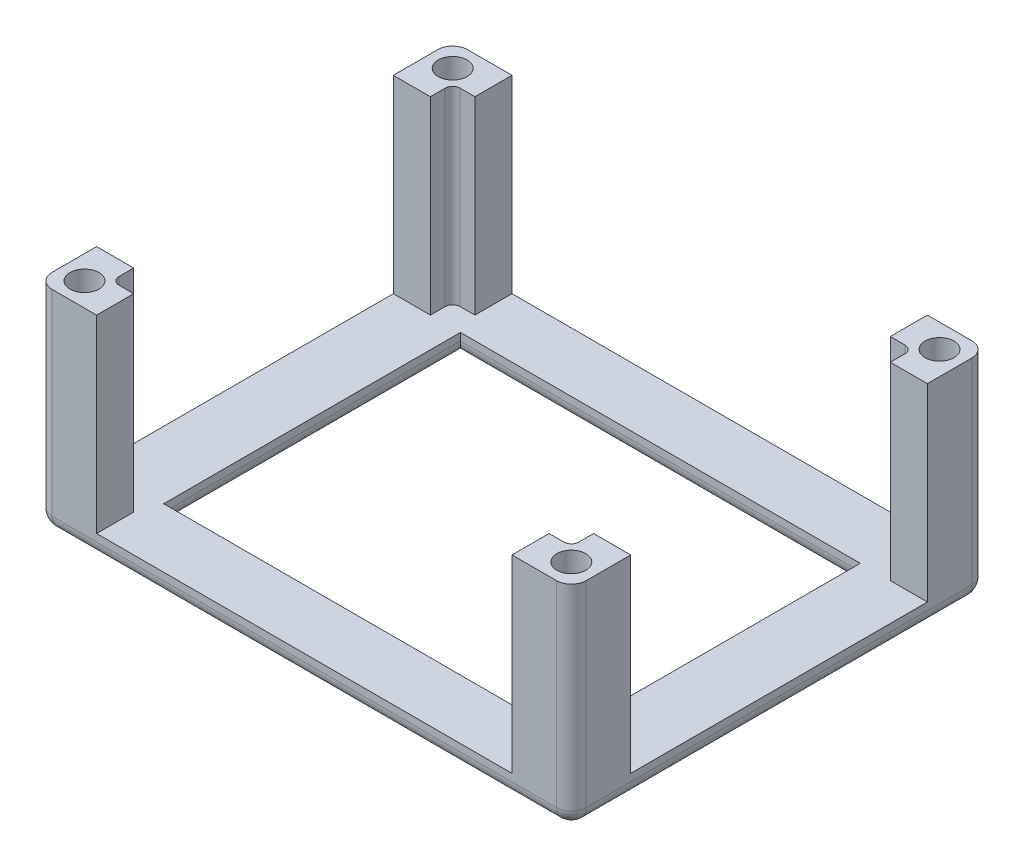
ISO-10303-21;
HEADER;
FILE_DESCRIPTION(('STEP AP214'),'2;1');
FILE_NAME('part.step','',(''),(''),'','','');
FILE_SCHEMA(('AUTOMOTIVE_DESIGN { 1 0 10303 214 1 1 1 1 }'));
ENDSEC;
DATA;
#1=APPLICATION_CONTEXT('core data for automotive mechanical design processes');
#2=APPLICATION_PROTOCOL_DEFINITION('international standard','automotive_design',2000,#1);
#3=PRODUCT_CONTEXT('',#1,'mechanical');
#4=PRODUCT('Part','Part','',(#3));
#5=PRODUCT_RELATED_PRODUCT_CATEGORY('part','',(#4));
#6=PRODUCT_DEFINITION_FORMATION('','',#4);
#7=PRODUCT_DEFINITION_CONTEXT('part definition',#1,'design');
#8=PRODUCT_DEFINITION('design','',#6,#7);
#9=PRODUCT_DEFINITION_SHAPE('','',#8);
#10=(LENGTH_UNIT() NAMED_UNIT(*) SI_UNIT(.MILLI.,.METRE.));
#11=(NAMED_UNIT(*) PLANE_ANGLE_UNIT() SI_UNIT($,.RADIAN.));
#12=(NAMED_UNIT(*) SI_UNIT($,.STERADIAN.) SOLID_ANGLE_UNIT());
#13=UNCERTAINTY_MEASURE_WITH_UNIT(LENGTH_MEASURE(1.E-05),#10,'distance_accuracy_value','');
#14=(GEOMETRIC_REPRESENTATION_CONTEXT(3) GLOBAL_UNCERTAINTY_ASSIGNED_CONTEXT((#13)) GLOBAL_UNIT_ASSIGNED_CONTEXT((#10,
#11,#12)) REPRESENTATION_CONTEXT('',''));
#15=CARTESIAN_POINT('',(0.,0.,0.));
#16=DIRECTION('',(0.,0.,1.));
#17=DIRECTION('',(1.,0.,0.));
#18=AXIS2_PLACEMENT_3D('',#15,#16,#17);
#19=CARTESIAN_POINT('',(-36.,-5.,0.));
#20=DIRECTION('',(1.,0.,0.));
#21=DIRECTION('',(0.,0.,-1.));
#22=AXIS2_PLACEMENT_3D('',#19,#20,#21);
#23=PLANE('',#22);
#24=DIRECTION('',(0.,0.,-1.));
#25=VECTOR('',#24,1.);
#26=CARTESIAN_POINT('',(-36.,25.5,0.));
#27=LINE('',#26,#25);
#28=CARTESIAN_POINT('',(-36.,25.5,-20.));
#29=VERTEX_POINT('',#28);
#30=CARTESIAN_POINT('',(-36.,25.5,-26.));
#31=VERTEX_POINT('',#30);
#32=EDGE_CURVE('E502',#29,#31,#27,.T.);
#33=ORIENTED_EDGE('',*,*,#32,.T.);
#34=DIRECTION('',(0.,1.,0.));
#35=VECTOR('',#34,1.);
#36=CARTESIAN_POINT('',(-36.,-5.,-26.));
#37=LINE('',#36,#35);
#38=CARTESIAN_POINT('',(-36.,-1.,-26.));
#39=VERTEX_POINT('',#38);
#40=EDGE_CURVE('E642',#31,#39,#37,.F.);
#41=ORIENTED_EDGE('',*,*,#40,.T.);
#42=DIRECTION('',(0.,0.,-1.));
#43=VECTOR('',#42,1.);
#44=CARTESIAN_POINT('',(-36.,-1.,28.));
#45=LINE('',#44,#43);
#46=CARTESIAN_POINT('',(-36.,-1.,26.));
#47=VERTEX_POINT('',#46);
#48=EDGE_CURVE('E640',#39,#47,#45,.F.);
#49=ORIENTED_EDGE('',*,*,#48,.T.);
#50=DIRECTION('',(0.,1.,0.));
#51=VECTOR('',#50,1.);
#52=CARTESIAN_POINT('',(-36.,25.5,26.));
#53=LINE('',#52,#51);
#54=CARTESIAN_POINT('',(-36.,25.5,26.));
#55=VERTEX_POINT('',#54);
#56=EDGE_CURVE('E638',#47,#55,#53,.T.);
#57=ORIENTED_EDGE('',*,*,#56,.T.);
#58=DIRECTION('',(0.,0.,-1.));
#59=VECTOR('',#58,1.);
#60=CARTESIAN_POINT('',(-36.,25.5,0.));
#61=LINE('',#60,#59);
#62=CARTESIAN_POINT('',(-36.,25.5,20.));
#63=VERTEX_POINT('',#62);
#64=EDGE_CURVE('E511',#55,#63,#61,.T.);
#65=ORIENTED_EDGE('',*,*,#64,.T.);
#66=DIRECTION('',(0.,1.,0.));
#67=VECTOR('',#66,1.);
#68=CARTESIAN_POINT('',(-36.,0.,20.));
#69=LINE('',#68,#67);
#70=CARTESIAN_POINT('',(-36.,0.,20.));
#71=VERTEX_POINT('',#70);
#72=EDGE_CURVE('E458',#71,#63,#69,.T.);
#73=ORIENTED_EDGE('',*,*,#72,.F.);
#74=DIRECTION('',(0.,0.,-1.));
#75=VECTOR('',#74,1.);
#76=CARTESIAN_POINT('',(-36.,0.,0.));
#77=LINE('',#76,#75);
#78=CARTESIAN_POINT('',(-36.,0.,-20.));
#79=VERTEX_POINT('',#78);
#80=EDGE_CURVE('E549',#71,#79,#77,.T.);
#81=ORIENTED_EDGE('',*,*,#80,.T.);
#82=DIRECTION('',(0.,1.,0.));
#83=VECTOR('',#82,1.);
#84=CARTESIAN_POINT('',(-36.,0.,-20.));
#85=LINE('',#84,#83);
#86=EDGE_CURVE('E488',#79,#29,#85,.T.);
#87=ORIENTED_EDGE('',*,*,#86,.T.);
#88=EDGE_LOOP('',(#33,#41,#49,#57,#65,#73,#81,#87));
#89=FACE_BOUND('',#88,.T.);
#90=ADVANCED_FACE('F111',(#89),#23,.F.);
#91=CARTESIAN_POINT('',(0.,-5.,-28.));
#92=DIRECTION('',(0.,0.,1.));
#93=DIRECTION('',(1.,0.,0.));
#94=AXIS2_PLACEMENT_3D('',#91,#92,#93);
#95=PLANE('',#94);
#96=DIRECTION('',(1.,0.,0.));
#97=VECTOR('',#96,1.);
#98=CARTESIAN_POINT('',(0.,25.5,-28.));
#99=LINE('',#98,#97);
#100=CARTESIAN_POINT('',(28.,25.5,-28.));
#101=VERTEX_POINT('',#100);
#102=CARTESIAN_POINT('',(34.,25.5,-28.));
#103=VERTEX_POINT('',#102);
#104=EDGE_CURVE('E533',#101,#103,#99,.T.);
#105=ORIENTED_EDGE('',*,*,#104,.T.);
#106=DIRECTION('',(0.,1.,0.));
#107=VECTOR('',#106,1.);
#108=CARTESIAN_POINT('',(34.,-3.,-28.));
#109=LINE('',#108,#107);
#110=CARTESIAN_POINT('',(34.,-1.,-28.));
#111=VERTEX_POINT('',#110);
#112=EDGE_CURVE('E636',#103,#111,#109,.F.);
#113=ORIENTED_EDGE('',*,*,#112,.T.);
#114=DIRECTION('',(1.,0.,0.));
#115=VECTOR('',#114,1.);
#116=CARTESIAN_POINT('',(-36.,-1.,-28.));
#117=LINE('',#116,#115);
#118=CARTESIAN_POINT('',(-34.,-1.,-28.));
#119=VERTEX_POINT('',#118);
#120=EDGE_CURVE('E633',#111,#119,#117,.F.);
#121=ORIENTED_EDGE('',*,*,#120,.T.);
#122=DIRECTION('',(0.,1.,0.));
#123=VECTOR('',#122,1.);
#124=CARTESIAN_POINT('',(-34.,-5.,-28.));
#125=LINE('',#124,#123);
#126=CARTESIAN_POINT('',(-34.,25.5,-28.));
#127=VERTEX_POINT('',#126);
#128=EDGE_CURVE('E631',#119,#127,#125,.T.);
#129=ORIENTED_EDGE('',*,*,#128,.T.);
#130=DIRECTION('',(1.,0.,0.));
#131=VECTOR('',#130,1.);
#132=CARTESIAN_POINT('',(0.,25.5,-28.));
#133=LINE('',#132,#131);
#134=CARTESIAN_POINT('',(-28.,25.5,-28.));
#135=VERTEX_POINT('',#134);
#136=EDGE_CURVE('E500',#127,#135,#133,.T.);
#137=ORIENTED_EDGE('',*,*,#136,.T.);
#138=DIRECTION('',(0.,1.,0.));
#139=VECTOR('',#138,1.);
#140=CARTESIAN_POINT('',(-28.,0.,-28.));
#141=LINE('',#140,#139);
#142=CARTESIAN_POINT('',(-28.,0.,-28.));
#143=VERTEX_POINT('',#142);
#144=EDGE_CURVE('E467',#143,#135,#141,.T.);
#145=ORIENTED_EDGE('',*,*,#144,.F.);
#146=DIRECTION('',(1.,0.,0.));
#147=VECTOR('',#146,1.);
#148=CARTESIAN_POINT('',(0.,0.,-28.));
#149=LINE('',#148,#147);
#150=CARTESIAN_POINT('',(28.,0.,-28.));
#151=VERTEX_POINT('',#150);
#152=EDGE_CURVE('E546',#143,#151,#149,.T.);
#153=ORIENTED_EDGE('',*,*,#152,.T.);
#154=DIRECTION('',(0.,1.,0.));
#155=VECTOR('',#154,1.);
#156=CARTESIAN_POINT('',(28.,0.,-28.));
#157=LINE('',#156,#155);
#158=EDGE_CURVE('E402',#151,#101,#157,.T.);
#159=ORIENTED_EDGE('',*,*,#158,.T.);
#160=EDGE_LOOP('',(#105,#113,#121,#129,#137,#145,#153,#159));
#161=FACE_BOUND('',#160,.T.);
#162=ADVANCED_FACE('F814',(#161),#95,.F.);
#163=CARTESIAN_POINT('',(36.,-5.,0.));
#164=DIRECTION('',(1.,0.,0.));
#165=DIRECTION('',(0.,0.,-1.));
#166=AXIS2_PLACEMENT_3D('',#163,#164,#165);
#167=PLANE('',#166);
#168=DIRECTION('',(0.,0.,1.));
#169=VECTOR('',#168,1.);
#170=CARTESIAN_POINT('',(36.,-1.,0.));
#171=LINE('',#170,#169);
#172=CARTESIAN_POINT('',(36.,-1.,26.));
#173=VERTEX_POINT('',#172);
#174=CARTESIAN_POINT('',(36.,-1.,-26.));
#175=VERTEX_POINT('',#174);
#176=EDGE_CURVE('E128',#173,#175,#171,.F.);
#177=ORIENTED_EDGE('',*,*,#176,.T.);
#178=DIRECTION('',(0.,1.,0.));
#179=VECTOR('',#178,1.);
#180=CARTESIAN_POINT('',(36.,25.5,-26.));
#181=LINE('',#180,#179);
#182=CARTESIAN_POINT('',(36.,25.5,-26.));
#183=VERTEX_POINT('',#182);
#184=EDGE_CURVE('E652',#175,#183,#181,.T.);
#185=ORIENTED_EDGE('',*,*,#184,.T.);
#186=DIRECTION('',(0.,0.,-1.));
#187=VECTOR('',#186,1.);
#188=CARTESIAN_POINT('',(36.,25.5,0.));
#189=LINE('',#188,#187);
#190=CARTESIAN_POINT('',(36.,25.5,-20.));
#191=VERTEX_POINT('',#190);
#192=EDGE_CURVE('E531',#191,#183,#189,.T.);
#193=ORIENTED_EDGE('',*,*,#192,.F.);
#194=DIRECTION('',(0.,1.,0.));
#195=VECTOR('',#194,1.);
#196=CARTESIAN_POINT('',(36.,0.,-20.));
#197=LINE('',#196,#195);
#198=CARTESIAN_POINT('',(36.,0.,-20.));
#199=VERTEX_POINT('',#198);
#200=EDGE_CURVE('E388',#199,#191,#197,.T.);
#201=ORIENTED_EDGE('',*,*,#200,.F.);
#202=DIRECTION('',(0.,0.,-1.));
#203=VECTOR('',#202,1.);
#204=CARTESIAN_POINT('',(36.,0.,0.));
#205=LINE('',#204,#203);
#206=CARTESIAN_POINT('',(36.,0.,20.));
#207=VERTEX_POINT('',#206);
#208=EDGE_CURVE('E542',#207,#199,#205,.T.);
#209=ORIENTED_EDGE('',*,*,#208,.F.);
#210=DIRECTION('',(0.,1.,0.));
#211=VECTOR('',#210,1.);
#212=CARTESIAN_POINT('',(36.,0.,20.));
#213=LINE('',#212,#211);
#214=CARTESIAN_POINT('',(36.,25.5,20.));
#215=VERTEX_POINT('',#214);
#216=EDGE_CURVE('E431',#207,#215,#213,.T.);
#217=ORIENTED_EDGE('',*,*,#216,.T.);
#218=DIRECTION('',(0.,0.,-1.));
#219=VECTOR('',#218,1.);
#220=CARTESIAN_POINT('',(36.,25.5,0.));
#221=LINE('',#220,#219);
#222=CARTESIAN_POINT('',(36.,25.5,26.));
#223=VERTEX_POINT('',#222);
#224=EDGE_CURVE('E524',#223,#215,#221,.T.);
#225=ORIENTED_EDGE('',*,*,#224,.F.);
#226=DIRECTION('',(0.,1.,0.));
#227=VECTOR('',#226,1.);
#228=CARTESIAN_POINT('',(36.,-5.,26.));
#229=LINE('',#228,#227);
#230=EDGE_CURVE('E133',#223,#173,#229,.F.);
#231=ORIENTED_EDGE('',*,*,#230,.T.);
#232=EDGE_LOOP('',(#177,#185,#193,#201,#209,#217,#225,#231));
#233=FACE_BOUND('',#232,.T.);
#234=ADVANCED_FACE('F735',(#233),#167,.T.);
#235=CARTESIAN_POINT('',(0.,-5.,28.));
#236=DIRECTION('',(0.,0.,1.));
#237=DIRECTION('',(1.,0.,0.));
#238=AXIS2_PLACEMENT_3D('',#235,#236,#237);
#239=PLANE('',#238);
#240=DIRECTION('',(-1.,0.,0.));
#241=VECTOR('',#240,1.);
#242=CARTESIAN_POINT('',(0.,-1.,28.));
#243=LINE('',#242,#241);
#244=CARTESIAN_POINT('',(-34.,-1.,28.));
#245=VERTEX_POINT('',#244);
#246=CARTESIAN_POINT('',(34.,-1.,28.));
#247=VERTEX_POINT('',#246);
#248=EDGE_CURVE('E646',#245,#247,#243,.F.);
#249=ORIENTED_EDGE('',*,*,#248,.T.);
#250=DIRECTION('',(0.,1.,0.));
#251=VECTOR('',#250,1.);
#252=CARTESIAN_POINT('',(34.,-5.,28.));
#253=LINE('',#252,#251);
#254=CARTESIAN_POINT('',(34.,25.5,28.));
#255=VERTEX_POINT('',#254);
#256=EDGE_CURVE('E648',#247,#255,#253,.T.);
#257=ORIENTED_EDGE('',*,*,#256,.T.);
#258=DIRECTION('',(1.,0.,0.));
#259=VECTOR('',#258,1.);
#260=CARTESIAN_POINT('',(0.,25.5,28.));
#261=LINE('',#260,#259);
#262=CARTESIAN_POINT('',(28.,25.5,28.));
#263=VERTEX_POINT('',#262);
#264=EDGE_CURVE('E521',#263,#255,#261,.T.);
#265=ORIENTED_EDGE('',*,*,#264,.F.);
#266=DIRECTION('',(0.,1.,0.));
#267=VECTOR('',#266,1.);
#268=CARTESIAN_POINT('',(28.,0.,28.));
#269=LINE('',#268,#267);
#270=CARTESIAN_POINT('',(28.,0.,28.));
#271=VERTEX_POINT('',#270);
#272=EDGE_CURVE('E410',#271,#263,#269,.T.);
#273=ORIENTED_EDGE('',*,*,#272,.F.);
#274=DIRECTION('',(1.,0.,0.));
#275=VECTOR('',#274,1.);
#276=CARTESIAN_POINT('',(0.,0.,28.));
#277=LINE('',#276,#275);
#278=CARTESIAN_POINT('',(-28.,0.,28.));
#279=VERTEX_POINT('',#278);
#280=EDGE_CURVE('E539',#279,#271,#277,.T.);
#281=ORIENTED_EDGE('',*,*,#280,.F.);
#282=DIRECTION('',(0.,1.,0.));
#283=VECTOR('',#282,1.);
#284=CARTESIAN_POINT('',(-28.,0.,28.));
#285=LINE('',#284,#283);
#286=CARTESIAN_POINT('',(-28.,25.5,28.));
#287=VERTEX_POINT('',#286);
#288=EDGE_CURVE('E440',#279,#287,#285,.T.);
#289=ORIENTED_EDGE('',*,*,#288,.T.);
#290=DIRECTION('',(1.,0.,0.));
#291=VECTOR('',#290,1.);
#292=CARTESIAN_POINT('',(0.,25.5,28.));
#293=LINE('',#292,#291);
#294=CARTESIAN_POINT('',(-34.,25.5,28.));
#295=VERTEX_POINT('',#294);
#296=EDGE_CURVE('E513',#295,#287,#293,.T.);
#297=ORIENTED_EDGE('',*,*,#296,.F.);
#298=DIRECTION('',(0.,1.,0.));
#299=VECTOR('',#298,1.);
#300=CARTESIAN_POINT('',(-34.,-3.,28.));
#301=LINE('',#300,#299);
#302=EDGE_CURVE('E644',#295,#245,#301,.F.);
#303=ORIENTED_EDGE('',*,*,#302,.T.);
#304=EDGE_LOOP('',(#249,#257,#265,#273,#281,#289,#297,#303));
#305=FACE_BOUND('',#304,.T.);
#306=ADVANCED_FACE('F726',(#305),#239,.T.);
#307=CARTESIAN_POINT('',(-26.9565217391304,-5.,20.));
#308=DIRECTION('',(0.,0.,1.));
#309=DIRECTION('',(1.,0.,0.));
#310=AXIS2_PLACEMENT_3D('',#307,#308,#309);
#311=PLANE('',#310);
#312=DIRECTION('',(0.,1.,0.));
#313=VECTOR('',#312,1.);
#314=CARTESIAN_POINT('',(26.9565217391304,-5.,20.));
#315=LINE('',#314,#313);
#316=CARTESIAN_POINT('',(26.9565217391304,-1.,20.));
#317=VERTEX_POINT('',#316);
#318=CARTESIAN_POINT('',(26.9565217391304,0.,20.));
#319=VERTEX_POINT('',#318);
#320=EDGE_CURVE('E567',#317,#319,#315,.T.);
#321=ORIENTED_EDGE('',*,*,#320,.F.);
#322=DIRECTION('',(1.,0.,0.));
#323=VECTOR('',#322,1.);
#324=CARTESIAN_POINT('',(-26.9565217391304,-1.,20.));
#325=LINE('',#324,#323);
#326=CARTESIAN_POINT('',(-26.9565217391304,-1.,20.));
#327=VERTEX_POINT('',#326);
#328=EDGE_CURVE('E629',#317,#327,#325,.F.);
#329=ORIENTED_EDGE('',*,*,#328,.T.);
#330=DIRECTION('',(0.,1.,0.));
#331=VECTOR('',#330,1.);
#332=CARTESIAN_POINT('',(-26.9565217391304,-5.,20.));
#333=LINE('',#332,#331);
#334=CARTESIAN_POINT('',(-26.9565217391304,0.,20.));
#335=VERTEX_POINT('',#334);
#336=EDGE_CURVE('E565',#327,#335,#333,.T.);
#337=ORIENTED_EDGE('',*,*,#336,.T.);
#338=DIRECTION('',(1.,0.,0.));
#339=VECTOR('',#338,1.);
#340=CARTESIAN_POINT('',(-26.9565217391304,0.,20.));
#341=LINE('',#340,#339);
#342=EDGE_CURVE('E557',#335,#319,#341,.T.);
#343=ORIENTED_EDGE('',*,*,#342,.T.);
#344=EDGE_LOOP('',(#321,#329,#337,#343));
#345=FACE_BOUND('',#344,.T.);
#346=ADVANCED_FACE('F828',(#345),#311,.F.);
#347=CARTESIAN_POINT('',(26.9565217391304,-5.,20.));
#348=DIRECTION('',(1.,0.,0.));
#349=DIRECTION('',(0.,0.,-1.));
#350=AXIS2_PLACEMENT_3D('',#347,#348,#349);
#351=PLANE('',#350);
#352=DIRECTION('',(0.,1.,0.));
#353=VECTOR('',#352,1.);
#354=CARTESIAN_POINT('',(26.9565217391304,-5.,-20.));
#355=LINE('',#354,#353);
#356=CARTESIAN_POINT('',(26.9565217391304,-1.,-20.));
#357=VERTEX_POINT('',#356);
#358=CARTESIAN_POINT('',(26.9565217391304,0.,-20.));
#359=VERTEX_POINT('',#358);
#360=EDGE_CURVE('E543',#357,#359,#355,.T.);
#361=ORIENTED_EDGE('',*,*,#360,.F.);
#362=DIRECTION('',(0.,0.,-1.));
#363=VECTOR('',#362,1.);
#364=CARTESIAN_POINT('',(26.9565217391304,-1.,20.));
#365=LINE('',#364,#363);
#366=EDGE_CURVE('E627',#357,#317,#365,.F.);
#367=ORIENTED_EDGE('',*,*,#366,.T.);
#368=ORIENTED_EDGE('',*,*,#320,.T.);
#369=DIRECTION('',(0.,0.,-1.));
#370=VECTOR('',#369,1.);
#371=CARTESIAN_POINT('',(26.9565217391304,0.,20.));
#372=LINE('',#371,#370);
#373=EDGE_CURVE('E554',#319,#359,#372,.T.);
#374=ORIENTED_EDGE('',*,*,#373,.T.);
#375=EDGE_LOOP('',(#361,#367,#368,#374));
#376=FACE_BOUND('',#375,.T.);
#377=ADVANCED_FACE('F837',(#376),#351,.F.);
#378=CARTESIAN_POINT('',(-26.9565217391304,-5.,-20.));
#379=DIRECTION('',(0.,0.,1.));
#380=DIRECTION('',(1.,0.,0.));
#381=AXIS2_PLACEMENT_3D('',#378,#379,#380);
#382=PLANE('',#381);
#383=DIRECTION('',(0.,1.,0.));
#384=VECTOR('',#383,1.);
#385=CARTESIAN_POINT('',(-26.9565217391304,-5.,-20.));
#386=LINE('',#385,#384);
#387=CARTESIAN_POINT('',(-26.9565217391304,-1.,-20.));
#388=VERTEX_POINT('',#387);
#389=CARTESIAN_POINT('',(-26.9565217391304,0.,-20.));
#390=VERTEX_POINT('',#389);
#391=EDGE_CURVE('E563',#388,#390,#386,.T.);
#392=ORIENTED_EDGE('',*,*,#391,.F.);
#393=DIRECTION('',(1.,0.,0.));
#394=VECTOR('',#393,1.);
#395=CARTESIAN_POINT('',(-26.9565217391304,-1.,-20.));
#396=LINE('',#395,#394);
#397=EDGE_CURVE('E625',#388,#357,#396,.T.);
#398=ORIENTED_EDGE('',*,*,#397,.T.);
#399=ORIENTED_EDGE('',*,*,#360,.T.);
#400=DIRECTION('',(1.,0.,0.));
#401=VECTOR('',#400,1.);
#402=CARTESIAN_POINT('',(-26.9565217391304,0.,-20.));
#403=LINE('',#402,#401);
#404=EDGE_CURVE('E536',#390,#359,#403,.T.);
#405=ORIENTED_EDGE('',*,*,#404,.F.);
#406=EDGE_LOOP('',(#392,#398,#399,#405));
#407=FACE_BOUND('',#406,.T.);
#408=ADVANCED_FACE('F833',(#407),#382,.T.);
#409=CARTESIAN_POINT('',(-26.9565217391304,-5.,20.));
#410=DIRECTION('',(1.,0.,0.));
#411=DIRECTION('',(0.,0.,-1.));
#412=AXIS2_PLACEMENT_3D('',#409,#410,#411);
#413=PLANE('',#412);
#414=ORIENTED_EDGE('',*,*,#336,.F.);
#415=DIRECTION('',(0.,0.,-1.));
#416=VECTOR('',#415,1.);
#417=CARTESIAN_POINT('',(-26.9565217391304,-1.,20.));
#418=LINE('',#417,#416);
#419=EDGE_CURVE('E604',#327,#388,#418,.T.);
#420=ORIENTED_EDGE('',*,*,#419,.T.);
#421=ORIENTED_EDGE('',*,*,#391,.T.);
#422=DIRECTION('',(0.,0.,-1.));
#423=VECTOR('',#422,1.);
#424=CARTESIAN_POINT('',(-26.9565217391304,0.,20.));
#425=LINE('',#424,#423);
#426=EDGE_CURVE('E560',#335,#390,#425,.T.);
#427=ORIENTED_EDGE('',*,*,#426,.F.);
#428=EDGE_LOOP('',(#414,#420,#421,#427));
#429=FACE_BOUND('',#428,.T.);
#430=ADVANCED_FACE('F829',(#429),#413,.T.);
#431=CARTESIAN_POINT('',(0.,25.5,-23.));
#432=DIRECTION('',(0.,0.,-1.));
#433=DIRECTION('',(-1.,0.,0.));
#434=AXIS2_PLACEMENT_3D('',#431,#432,#433);
#435=PLANE('',#434);
#436=DIRECTION('',(1.,0.,0.));
#437=VECTOR('',#436,1.);
#438=CARTESIAN_POINT('',(0.,0.,-23.));
#439=LINE('',#438,#437);
#440=CARTESIAN_POINT('',(28.,0.,-23.));
#441=VERTEX_POINT('',#440);
#442=CARTESIAN_POINT('',(30.,0.,-23.));
#443=VERTEX_POINT('',#442);
#444=EDGE_CURVE('E526',#441,#443,#439,.T.);
#445=ORIENTED_EDGE('',*,*,#444,.T.);
#446=DIRECTION('',(0.,1.,0.));
#447=VECTOR('',#446,1.);
#448=CARTESIAN_POINT('',(30.,25.5,-23.));
#449=LINE('',#448,#447);
#450=CARTESIAN_POINT('',(30.,25.5,-23.));
#451=VERTEX_POINT('',#450);
#452=EDGE_CURVE('E587',#443,#451,#449,.T.);
#453=ORIENTED_EDGE('',*,*,#452,.T.);
#454=DIRECTION('',(1.,0.,0.));
#455=VECTOR('',#454,1.);
#456=CARTESIAN_POINT('',(0.,25.5,-23.));
#457=LINE('',#456,#455);
#458=CARTESIAN_POINT('',(28.,25.5,-23.));
#459=VERTEX_POINT('',#458);
#460=EDGE_CURVE('E529',#459,#451,#457,.T.);
#461=ORIENTED_EDGE('',*,*,#460,.F.);
#462=DIRECTION('',(0.,1.,0.));
#463=VECTOR('',#462,1.);
#464=CARTESIAN_POINT('',(28.,0.,-23.));
#465=LINE('',#464,#463);
#466=EDGE_CURVE('E404',#441,#459,#465,.T.);
#467=ORIENTED_EDGE('',*,*,#466,.F.);
#468=EDGE_LOOP('',(#445,#453,#461,#467));
#469=FACE_BOUND('',#468,.T.);
#470=ADVANCED_FACE('F832',(#469),#435,.F.);
#471=CARTESIAN_POINT('',(0.,0.,0.));
#472=DIRECTION('',(0.,1.,0.));
#473=DIRECTION('',(0.,0.,1.));
#474=AXIS2_PLACEMENT_3D('',#471,#472,#473);
#475=PLANE('',#474);
#476=DIRECTION('',(1.,0.,0.));
#477=VECTOR('',#476,1.);
#478=CARTESIAN_POINT('',(0.,0.,23.));
#479=LINE('',#478,#477);
#480=CARTESIAN_POINT('',(28.,0.,23.));
#481=VERTEX_POINT('',#480);
#482=CARTESIAN_POINT('',(30.,0.,23.));
#483=VERTEX_POINT('',#482);
#484=EDGE_CURVE('E422',#481,#483,#479,.T.);
#485=ORIENTED_EDGE('',*,*,#484,.T.);
#486=CARTESIAN_POINT('',(30.,0.,22.));
#487=DIRECTION('',(0.,1.,0.));
#488=DIRECTION('',(0.,0.,1.));
#489=AXIS2_PLACEMENT_3D('',#486,#487,#488);
#490=CIRCLE('',#489,1.);
#491=CARTESIAN_POINT('',(31.,0.,22.));
#492=VERTEX_POINT('',#491);
#493=EDGE_CURVE('E580',#483,#492,#490,.T.);
#494=ORIENTED_EDGE('',*,*,#493,.T.);
#495=DIRECTION('',(0.,0.,1.));
#496=VECTOR('',#495,1.);
#497=CARTESIAN_POINT('',(31.,0.,0.));
#498=LINE('',#497,#496);
#499=CARTESIAN_POINT('',(31.,0.,20.));
#500=VERTEX_POINT('',#499);
#501=EDGE_CURVE('E515',#500,#492,#498,.T.);
#502=ORIENTED_EDGE('',*,*,#501,.F.);
#503=DIRECTION('',(-1.,0.,0.));
#504=VECTOR('',#503,1.);
#505=CARTESIAN_POINT('',(0.,0.,20.));
#506=LINE('',#505,#504);
#507=EDGE_CURVE('E428',#207,#500,#506,.T.);
#508=ORIENTED_EDGE('',*,*,#507,.F.);
#509=ORIENTED_EDGE('',*,*,#208,.T.);
#510=DIRECTION('',(1.,0.,0.));
#511=VECTOR('',#510,1.);
#512=CARTESIAN_POINT('',(0.,0.,-20.));
#513=LINE('',#512,#511);
#514=CARTESIAN_POINT('',(31.,0.,-20.));
#515=VERTEX_POINT('',#514);
#516=EDGE_CURVE('E399',#515,#199,#513,.T.);
#517=ORIENTED_EDGE('',*,*,#516,.F.);
#518=DIRECTION('',(0.,0.,-1.));
#519=VECTOR('',#518,1.);
#520=CARTESIAN_POINT('',(31.,0.,0.));
#521=LINE('',#520,#519);
#522=CARTESIAN_POINT('',(31.,0.,-22.));
#523=VERTEX_POINT('',#522);
#524=EDGE_CURVE('E375',#515,#523,#521,.T.);
#525=ORIENTED_EDGE('',*,*,#524,.T.);
#526=CARTESIAN_POINT('',(30.,0.,-22.));
#527=DIRECTION('',(0.,1.,0.));
#528=DIRECTION('',(0.,0.,1.));
#529=AXIS2_PLACEMENT_3D('',#526,#527,#528);
#530=CIRCLE('',#529,1.);
#531=EDGE_CURVE('E576',#523,#443,#530,.T.);
#532=ORIENTED_EDGE('',*,*,#531,.T.);
#533=ORIENTED_EDGE('',*,*,#444,.F.);
#534=DIRECTION('',(0.,0.,-1.));
#535=VECTOR('',#534,1.);
#536=CARTESIAN_POINT('',(28.,0.,0.));
#537=LINE('',#536,#535);
#538=EDGE_CURVE('E395',#441,#151,#537,.T.);
#539=ORIENTED_EDGE('',*,*,#538,.T.);
#540=ORIENTED_EDGE('',*,*,#152,.F.);
#541=DIRECTION('',(0.,0.,1.));
#542=VECTOR('',#541,1.);
#543=CARTESIAN_POINT('',(-28.,0.,0.));
#544=LINE('',#543,#542);
#545=CARTESIAN_POINT('',(-28.,0.,-23.));
#546=VERTEX_POINT('',#545);
#547=EDGE_CURVE('E474',#143,#546,#544,.T.);
#548=ORIENTED_EDGE('',*,*,#547,.T.);
#549=DIRECTION('',(-1.,0.,0.));
#550=VECTOR('',#549,1.);
#551=CARTESIAN_POINT('',(0.,0.,-23.));
#552=LINE('',#551,#550);
#553=CARTESIAN_POINT('',(-30.,0.,-23.));
#554=VERTEX_POINT('',#553);
#555=EDGE_CURVE('E479',#546,#554,#552,.T.);
#556=ORIENTED_EDGE('',*,*,#555,.T.);
#557=CARTESIAN_POINT('',(-30.,0.,-22.));
#558=DIRECTION('',(0.,1.,0.));
#559=DIRECTION('',(0.,0.,1.));
#560=AXIS2_PLACEMENT_3D('',#557,#558,#559);
#561=CIRCLE('',#560,1.);
#562=CARTESIAN_POINT('',(-31.,0.,-22.));
#563=VERTEX_POINT('',#562);
#564=EDGE_CURVE('E574',#554,#563,#561,.T.);
#565=ORIENTED_EDGE('',*,*,#564,.T.);
#566=DIRECTION('',(0.,0.,-1.));
#567=VECTOR('',#566,1.);
#568=CARTESIAN_POINT('',(-31.,0.,0.));
#569=LINE('',#568,#567);
#570=CARTESIAN_POINT('',(-31.,0.,-20.));
#571=VERTEX_POINT('',#570);
#572=EDGE_CURVE('E494',#571,#563,#569,.T.);
#573=ORIENTED_EDGE('',*,*,#572,.F.);
#574=DIRECTION('',(1.,0.,0.));
#575=VECTOR('',#574,1.);
#576=CARTESIAN_POINT('',(0.,0.,-20.));
#577=LINE('',#576,#575);
#578=EDGE_CURVE('E485',#79,#571,#577,.T.);
#579=ORIENTED_EDGE('',*,*,#578,.F.);
#580=ORIENTED_EDGE('',*,*,#80,.F.);
#581=DIRECTION('',(-1.,0.,0.));
#582=VECTOR('',#581,1.);
#583=CARTESIAN_POINT('',(0.,0.,20.));
#584=LINE('',#583,#582);
#585=CARTESIAN_POINT('',(-31.,0.,20.));
#586=VERTEX_POINT('',#585);
#587=EDGE_CURVE('E455',#586,#71,#584,.T.);
#588=ORIENTED_EDGE('',*,*,#587,.F.);
#589=DIRECTION('',(0.,0.,1.));
#590=VECTOR('',#589,1.);
#591=CARTESIAN_POINT('',(-31.,0.,0.));
#592=LINE('',#591,#590);
#593=CARTESIAN_POINT('',(-31.,0.,22.));
#594=VERTEX_POINT('',#593);
#595=EDGE_CURVE('E505',#586,#594,#592,.T.);
#596=ORIENTED_EDGE('',*,*,#595,.T.);
#597=CARTESIAN_POINT('',(-30.,0.,22.));
#598=DIRECTION('',(0.,1.,0.));
#599=DIRECTION('',(0.,0.,1.));
#600=AXIS2_PLACEMENT_3D('',#597,#598,#599);
#601=CIRCLE('',#600,1.);
#602=CARTESIAN_POINT('',(-30.,0.,23.));
#603=VERTEX_POINT('',#602);
#604=EDGE_CURVE('E578',#594,#603,#601,.T.);
#605=ORIENTED_EDGE('',*,*,#604,.T.);
#606=DIRECTION('',(1.,0.,0.));
#607=VECTOR('',#606,1.);
#608=CARTESIAN_POINT('',(0.,0.,23.));
#609=LINE('',#608,#607);
#610=CARTESIAN_POINT('',(-28.,0.,23.));
#611=VERTEX_POINT('',#610);
#612=EDGE_CURVE('E443',#603,#611,#609,.T.);
#613=ORIENTED_EDGE('',*,*,#612,.T.);
#614=DIRECTION('',(0.,0.,1.));
#615=VECTOR('',#614,1.);
#616=CARTESIAN_POINT('',(-28.,0.,0.));
#617=LINE('',#616,#615);
#618=EDGE_CURVE('E452',#611,#279,#617,.T.);
#619=ORIENTED_EDGE('',*,*,#618,.T.);
#620=ORIENTED_EDGE('',*,*,#280,.T.);
#621=DIRECTION('',(0.,0.,-1.));
#622=VECTOR('',#621,1.);
#623=CARTESIAN_POINT('',(28.,0.,0.));
#624=LINE('',#623,#622);
#625=EDGE_CURVE('E417',#271,#481,#624,.T.);
#626=ORIENTED_EDGE('',*,*,#625,.T.);
#627=EDGE_LOOP('',(#485,#494,#502,#508,#509,#517,#525,#532,#533,#539,#540,#548,#556,#565,#573,
#579,#580,#588,#596,#605,#613,#619,#620,#626));
#628=FACE_BOUND('',#627,.T.);
#629=ORIENTED_EDGE('',*,*,#426,.T.);
#630=ORIENTED_EDGE('',*,*,#404,.T.);
#631=ORIENTED_EDGE('',*,*,#373,.F.);
#632=ORIENTED_EDGE('',*,*,#342,.F.);
#633=EDGE_LOOP('',(#629,#630,#631,#632));
#634=FACE_BOUND('',#633,.T.);
#635=ADVANCED_FACE('F753',(#628,#634),#475,.T.);
#636=CARTESIAN_POINT('',(31.,25.5,0.));
#637=DIRECTION('',(1.,0.,0.));
#638=DIRECTION('',(0.,0.,-1.));
#639=AXIS2_PLACEMENT_3D('',#636,#637,#638);
#640=PLANE('',#639);
#641=ORIENTED_EDGE('',*,*,#501,.T.);
#642=DIRECTION('',(0.,1.,0.));
#643=VECTOR('',#642,1.);
#644=CARTESIAN_POINT('',(31.,25.5,22.));
#645=LINE('',#644,#643);
#646=CARTESIAN_POINT('',(31.,25.5,22.));
#647=VERTEX_POINT('',#646);
#648=EDGE_CURVE('E551',#492,#647,#645,.T.);
#649=ORIENTED_EDGE('',*,*,#648,.T.);
#650=DIRECTION('',(0.,0.,1.));
#651=VECTOR('',#650,1.);
#652=CARTESIAN_POINT('',(31.,25.5,0.));
#653=LINE('',#652,#651);
#654=CARTESIAN_POINT('',(31.,25.5,20.));
#655=VERTEX_POINT('',#654);
#656=EDGE_CURVE('E518',#655,#647,#653,.T.);
#657=ORIENTED_EDGE('',*,*,#656,.F.);
#658=DIRECTION('',(0.,1.,0.));
#659=VECTOR('',#658,1.);
#660=CARTESIAN_POINT('',(31.,0.,20.));
#661=LINE('',#660,#659);
#662=EDGE_CURVE('E434',#500,#655,#661,.T.);
#663=ORIENTED_EDGE('',*,*,#662,.F.);
#664=EDGE_LOOP('',(#641,#649,#657,#663));
#665=FACE_BOUND('',#664,.T.);
#666=ADVANCED_FACE('F743',(#665),#640,.F.);
#667=CARTESIAN_POINT('',(-31.,25.5,0.));
#668=DIRECTION('',(1.,0.,0.));
#669=DIRECTION('',(0.,0.,-1.));
#670=AXIS2_PLACEMENT_3D('',#667,#668,#669);
#671=PLANE('',#670);
#672=DIRECTION('',(0.,0.,1.));
#673=VECTOR('',#672,1.);
#674=CARTESIAN_POINT('',(-31.,25.5,0.));
#675=LINE('',#674,#673);
#676=CARTESIAN_POINT('',(-31.,25.5,20.));
#677=VERTEX_POINT('',#676);
#678=CARTESIAN_POINT('',(-31.,25.5,22.));
#679=VERTEX_POINT('',#678);
#680=EDGE_CURVE('E508',#677,#679,#675,.T.);
#681=ORIENTED_EDGE('',*,*,#680,.T.);
#682=DIRECTION('',(0.,1.,0.));
#683=VECTOR('',#682,1.);
#684=CARTESIAN_POINT('',(-31.,25.5,22.));
#685=LINE('',#684,#683);
#686=EDGE_CURVE('E585',#679,#594,#685,.F.);
#687=ORIENTED_EDGE('',*,*,#686,.T.);
#688=ORIENTED_EDGE('',*,*,#595,.F.);
#689=DIRECTION('',(0.,1.,0.));
#690=VECTOR('',#689,1.);
#691=CARTESIAN_POINT('',(-31.,0.,20.));
#692=LINE('',#691,#690);
#693=EDGE_CURVE('E461',#586,#677,#692,.T.);
#694=ORIENTED_EDGE('',*,*,#693,.T.);
#695=EDGE_LOOP('',(#681,#687,#688,#694));
#696=FACE_BOUND('',#695,.T.);
#697=ADVANCED_FACE('F1324',(#696),#671,.T.);
#698=CARTESIAN_POINT('',(-31.,25.5,0.));
#699=DIRECTION('',(-1.,0.,0.));
#700=DIRECTION('',(0.,0.,1.));
#701=AXIS2_PLACEMENT_3D('',#698,#699,#700);
#702=PLANE('',#701);
#703=ORIENTED_EDGE('',*,*,#572,.T.);
#704=DIRECTION('',(0.,1.,0.));
#705=VECTOR('',#704,1.);
#706=CARTESIAN_POINT('',(-31.,25.5,-22.));
#707=LINE('',#706,#705);
#708=CARTESIAN_POINT('',(-31.,25.5,-22.));
#709=VERTEX_POINT('',#708);
#710=EDGE_CURVE('E592',#563,#709,#707,.T.);
#711=ORIENTED_EDGE('',*,*,#710,.T.);
#712=DIRECTION('',(0.,0.,-1.));
#713=VECTOR('',#712,1.);
#714=CARTESIAN_POINT('',(-31.,25.5,0.));
#715=LINE('',#714,#713);
#716=CARTESIAN_POINT('',(-31.,25.5,-20.));
#717=VERTEX_POINT('',#716);
#718=EDGE_CURVE('E497',#717,#709,#715,.T.);
#719=ORIENTED_EDGE('',*,*,#718,.F.);
#720=DIRECTION('',(0.,1.,0.));
#721=VECTOR('',#720,1.);
#722=CARTESIAN_POINT('',(-31.,0.,-20.));
#723=LINE('',#722,#721);
#724=EDGE_CURVE('E491',#571,#717,#723,.T.);
#725=ORIENTED_EDGE('',*,*,#724,.F.);
#726=EDGE_LOOP('',(#703,#711,#719,#725));
#727=FACE_BOUND('',#726,.T.);
#728=ADVANCED_FACE('F1336',(#727),#702,.F.);
#729=CARTESIAN_POINT('',(0.,25.5,0.));
#730=DIRECTION('',(0.,1.,0.));
#731=DIRECTION('',(0.,0.,1.));
#732=AXIS2_PLACEMENT_3D('',#729,#730,#731);
#733=PLANE('',#732);
#734=CARTESIAN_POINT('',(32.8180194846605,25.5,-24.8180194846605));
#735=DIRECTION('',(0.,1.,0.));
#736=DIRECTION('',(0.,0.,1.));
#737=AXIS2_PLACEMENT_3D('',#734,#735,#736);
#738=CIRCLE('',#737,1.95);
#739=CARTESIAN_POINT('',(32.8180194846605,25.5,-22.8680194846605));
#740=VERTEX_POINT('',#739);
#741=EDGE_CURVE('E669',#740,#740,#738,.T.);
#742=ORIENTED_EDGE('',*,*,#741,.F.);
#743=EDGE_LOOP('',(#742));
#744=FACE_BOUND('',#743,.T.);
#745=ORIENTED_EDGE('',*,*,#192,.T.);
#746=CARTESIAN_POINT('',(34.,25.5,-26.));
#747=DIRECTION('',(0.,1.,0.));
#748=DIRECTION('',(0.,0.,1.));
#749=AXIS2_PLACEMENT_3D('',#746,#747,#748);
#750=CIRCLE('',#749,2.);
#751=EDGE_CURVE('E654',#183,#103,#750,.T.);
#752=ORIENTED_EDGE('',*,*,#751,.T.);
#753=ORIENTED_EDGE('',*,*,#104,.F.);
#754=DIRECTION('',(0.,0.,-1.));
#755=VECTOR('',#754,1.);
#756=CARTESIAN_POINT('',(28.,25.5,0.));
#757=LINE('',#756,#755);
#758=EDGE_CURVE('E392',#459,#101,#757,.T.);
#759=ORIENTED_EDGE('',*,*,#758,.F.);
#760=ORIENTED_EDGE('',*,*,#460,.T.);
#761=CARTESIAN_POINT('',(30.,25.5,-22.));
#762=DIRECTION('',(0.,1.,0.));
#763=DIRECTION('',(0.,0.,1.));
#764=AXIS2_PLACEMENT_3D('',#761,#762,#763);
#765=CIRCLE('',#764,1.);
#766=CARTESIAN_POINT('',(31.,25.5,-22.));
#767=VERTEX_POINT('',#766);
#768=EDGE_CURVE('E387',#451,#767,#765,.F.);
#769=ORIENTED_EDGE('',*,*,#768,.T.);
#770=DIRECTION('',(0.,0.,-1.));
#771=VECTOR('',#770,1.);
#772=CARTESIAN_POINT('',(31.,25.5,0.));
#773=LINE('',#772,#771);
#774=CARTESIAN_POINT('',(31.,25.5,-20.));
#775=VERTEX_POINT('',#774);
#776=EDGE_CURVE('E372',#775,#767,#773,.T.);
#777=ORIENTED_EDGE('',*,*,#776,.F.);
#778=DIRECTION('',(1.,0.,0.));
#779=VECTOR('',#778,1.);
#780=CARTESIAN_POINT('',(0.,25.5,-20.));
#781=LINE('',#780,#779);
#782=EDGE_CURVE('E385',#775,#191,#781,.T.);
#783=ORIENTED_EDGE('',*,*,#782,.T.);
#784=EDGE_LOOP('',(#745,#752,#753,#759,#760,#769,#777,#783));
#785=FACE_BOUND('',#784,.T.);
#786=ADVANCED_FACE('F384',(#744,#785),#733,.T.);
#787=CARTESIAN_POINT('',(0.,25.5,0.));
#788=DIRECTION('',(0.,1.,0.));
#789=DIRECTION('',(0.,0.,1.));
#790=AXIS2_PLACEMENT_3D('',#787,#788,#789);
#791=PLANE('',#790);
#792=CARTESIAN_POINT('',(32.8180194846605,25.5,24.8180194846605));
#793=DIRECTION('',(0.,1.,0.));
#794=DIRECTION('',(0.,0.,1.));
#795=AXIS2_PLACEMENT_3D('',#792,#793,#794);
#796=CIRCLE('',#795,1.95);
#797=CARTESIAN_POINT('',(32.8180194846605,25.5,26.7680194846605));
#798=VERTEX_POINT('',#797);
#799=EDGE_CURVE('E1502',#798,#798,#796,.T.);
#800=ORIENTED_EDGE('',*,*,#799,.F.);
#801=EDGE_LOOP('',(#800));
#802=FACE_BOUND('',#801,.T.);
#803=ORIENTED_EDGE('',*,*,#264,.T.);
#804=CARTESIAN_POINT('',(34.,25.5,26.));
#805=DIRECTION('',(0.,1.,0.));
#806=DIRECTION('',(0.,0.,1.));
#807=AXIS2_PLACEMENT_3D('',#804,#805,#806);
#808=CIRCLE('',#807,2.);
#809=EDGE_CURVE('E120',#255,#223,#808,.T.);
#810=ORIENTED_EDGE('',*,*,#809,.T.);
#811=ORIENTED_EDGE('',*,*,#224,.T.);
#812=DIRECTION('',(-1.,0.,0.));
#813=VECTOR('',#812,1.);
#814=CARTESIAN_POINT('',(0.,25.5,20.));
#815=LINE('',#814,#813);
#816=EDGE_CURVE('E425',#215,#655,#815,.T.);
#817=ORIENTED_EDGE('',*,*,#816,.T.);
#818=ORIENTED_EDGE('',*,*,#656,.T.);
#819=CARTESIAN_POINT('',(30.,25.5,22.));
#820=DIRECTION('',(0.,1.,0.));
#821=DIRECTION('',(0.,0.,1.));
#822=AXIS2_PLACEMENT_3D('',#819,#820,#821);
#823=CIRCLE('',#822,1.);
#824=CARTESIAN_POINT('',(30.,25.5,23.));
#825=VERTEX_POINT('',#824);
#826=EDGE_CURVE('E597',#647,#825,#823,.F.);
#827=ORIENTED_EDGE('',*,*,#826,.T.);
#828=DIRECTION('',(1.,0.,0.));
#829=VECTOR('',#828,1.);
#830=CARTESIAN_POINT('',(0.,25.5,23.));
#831=LINE('',#830,#829);
#832=CARTESIAN_POINT('',(28.,25.5,23.));
#833=VERTEX_POINT('',#832);
#834=EDGE_CURVE('E413',#833,#825,#831,.T.);
#835=ORIENTED_EDGE('',*,*,#834,.F.);
#836=DIRECTION('',(0.,0.,-1.));
#837=VECTOR('',#836,1.);
#838=CARTESIAN_POINT('',(28.,25.5,0.));
#839=LINE('',#838,#837);
#840=EDGE_CURVE('E407',#263,#833,#839,.T.);
#841=ORIENTED_EDGE('',*,*,#840,.F.);
#842=EDGE_LOOP('',(#803,#810,#811,#817,#818,#827,#835,#841));
#843=FACE_BOUND('',#842,.T.);
#844=ADVANCED_FACE('F733',(#802,#843),#791,.T.);
#845=CARTESIAN_POINT('',(0.,25.5,0.));
#846=DIRECTION('',(0.,1.,0.));
#847=DIRECTION('',(0.,0.,1.));
#848=AXIS2_PLACEMENT_3D('',#845,#846,#847);
#849=PLANE('',#848);
#850=CARTESIAN_POINT('',(-32.8180194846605,25.5,24.8180194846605));
#851=DIRECTION('',(0.,1.,0.));
#852=DIRECTION('',(0.,0.,1.));
#853=AXIS2_PLACEMENT_3D('',#850,#851,#852);
#854=CIRCLE('',#853,1.95);
#855=CARTESIAN_POINT('',(-32.8180194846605,25.5,26.7680194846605));
#856=VERTEX_POINT('',#855);
#857=EDGE_CURVE('E1515',#856,#856,#854,.T.);
#858=ORIENTED_EDGE('',*,*,#857,.F.);
#859=EDGE_LOOP('',(#858));
#860=FACE_BOUND('',#859,.T.);
#861=ORIENTED_EDGE('',*,*,#64,.F.);
#862=CARTESIAN_POINT('',(-34.,25.5,26.));
#863=DIRECTION('',(0.,1.,0.));
#864=DIRECTION('',(0.,0.,1.));
#865=AXIS2_PLACEMENT_3D('',#862,#863,#864);
#866=CIRCLE('',#865,2.);
#867=EDGE_CURVE('E12',#55,#295,#866,.T.);
#868=ORIENTED_EDGE('',*,*,#867,.T.);
#869=ORIENTED_EDGE('',*,*,#296,.T.);
#870=DIRECTION('',(0.,0.,1.));
#871=VECTOR('',#870,1.);
#872=CARTESIAN_POINT('',(-28.,25.5,0.));
#873=LINE('',#872,#871);
#874=CARTESIAN_POINT('',(-28.,25.5,23.));
#875=VERTEX_POINT('',#874);
#876=EDGE_CURVE('E447',#875,#287,#873,.T.);
#877=ORIENTED_EDGE('',*,*,#876,.F.);
#878=DIRECTION('',(1.,0.,0.));
#879=VECTOR('',#878,1.);
#880=CARTESIAN_POINT('',(0.,25.5,23.));
#881=LINE('',#880,#879);
#882=CARTESIAN_POINT('',(-30.,25.5,23.));
#883=VERTEX_POINT('',#882);
#884=EDGE_CURVE('E437',#883,#875,#881,.T.);
#885=ORIENTED_EDGE('',*,*,#884,.F.);
#886=CARTESIAN_POINT('',(-30.,25.5,22.));
#887=DIRECTION('',(0.,1.,0.));
#888=DIRECTION('',(0.,0.,1.));
#889=AXIS2_PLACEMENT_3D('',#886,#887,#888);
#890=CIRCLE('',#889,1.);
#891=EDGE_CURVE('E599',#883,#679,#890,.F.);
#892=ORIENTED_EDGE('',*,*,#891,.T.);
#893=ORIENTED_EDGE('',*,*,#680,.F.);
#894=DIRECTION('',(-1.,0.,0.));
#895=VECTOR('',#894,1.);
#896=CARTESIAN_POINT('',(0.,25.5,20.));
#897=LINE('',#896,#895);
#898=EDGE_CURVE('E454',#677,#63,#897,.T.);
#899=ORIENTED_EDGE('',*,*,#898,.T.);
#900=EDGE_LOOP('',(#861,#868,#869,#877,#885,#892,#893,#899));
#901=FACE_BOUND('',#900,.T.);
#902=ADVANCED_FACE('F768',(#860,#901),#849,.T.);
#903=CARTESIAN_POINT('',(0.,25.5,0.));
#904=DIRECTION('',(0.,1.,0.));
#905=DIRECTION('',(0.,0.,1.));
#906=AXIS2_PLACEMENT_3D('',#903,#904,#905);
#907=PLANE('',#906);
#908=CARTESIAN_POINT('',(-32.8180194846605,25.5,-24.8180194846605));
#909=DIRECTION('',(0.,1.,0.));
#910=DIRECTION('',(0.,0.,1.));
#911=AXIS2_PLACEMENT_3D('',#908,#909,#910);
#912=CIRCLE('',#911,1.95);
#913=CARTESIAN_POINT('',(-32.8180194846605,25.5,-22.8680194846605));
#914=VERTEX_POINT('',#913);
#915=EDGE_CURVE('E1508',#914,#914,#912,.T.);
#916=ORIENTED_EDGE('',*,*,#915,.F.);
#917=EDGE_LOOP('',(#916));
#918=FACE_BOUND('',#917,.T.);
#919=ORIENTED_EDGE('',*,*,#136,.F.);
#920=CARTESIAN_POINT('',(-34.,25.5,-26.));
#921=DIRECTION('',(0.,1.,0.));
#922=DIRECTION('',(0.,0.,1.));
#923=AXIS2_PLACEMENT_3D('',#920,#921,#922);
#924=CIRCLE('',#923,2.);
#925=EDGE_CURVE('E656',#127,#31,#924,.T.);
#926=ORIENTED_EDGE('',*,*,#925,.T.);
#927=ORIENTED_EDGE('',*,*,#32,.F.);
#928=DIRECTION('',(1.,0.,0.));
#929=VECTOR('',#928,1.);
#930=CARTESIAN_POINT('',(0.,25.5,-20.));
#931=LINE('',#930,#929);
#932=EDGE_CURVE('E482',#29,#717,#931,.T.);
#933=ORIENTED_EDGE('',*,*,#932,.T.);
#934=ORIENTED_EDGE('',*,*,#718,.T.);
#935=CARTESIAN_POINT('',(-30.,25.5,-22.));
#936=DIRECTION('',(0.,1.,0.));
#937=DIRECTION('',(0.,0.,1.));
#938=AXIS2_PLACEMENT_3D('',#935,#936,#937);
#939=CIRCLE('',#938,1.);
#940=CARTESIAN_POINT('',(-30.,25.5,-23.));
#941=VERTEX_POINT('',#940);
#942=EDGE_CURVE('E602',#709,#941,#939,.F.);
#943=ORIENTED_EDGE('',*,*,#942,.T.);
#944=DIRECTION('',(-1.,0.,0.));
#945=VECTOR('',#944,1.);
#946=CARTESIAN_POINT('',(0.,25.5,-23.));
#947=LINE('',#946,#945);
#948=CARTESIAN_POINT('',(-28.,25.5,-23.));
#949=VERTEX_POINT('',#948);
#950=EDGE_CURVE('E470',#949,#941,#947,.T.);
#951=ORIENTED_EDGE('',*,*,#950,.F.);
#952=DIRECTION('',(0.,0.,1.));
#953=VECTOR('',#952,1.);
#954=CARTESIAN_POINT('',(-28.,25.5,0.));
#955=LINE('',#954,#953);
#956=EDGE_CURVE('E464',#135,#949,#955,.T.);
#957=ORIENTED_EDGE('',*,*,#956,.F.);
#958=EDGE_LOOP('',(#919,#926,#927,#933,#934,#943,#951,#957));
#959=FACE_BOUND('',#958,.T.);
#960=ADVANCED_FACE('F785',(#918,#959),#907,.T.);
#961=CARTESIAN_POINT('',(0.,0.,-20.));
#962=DIRECTION('',(0.,0.,1.));
#963=DIRECTION('',(1.,0.,0.));
#964=AXIS2_PLACEMENT_3D('',#961,#962,#963);
#965=PLANE('',#964);
#966=ORIENTED_EDGE('',*,*,#932,.F.);
#967=ORIENTED_EDGE('',*,*,#86,.F.);
#968=ORIENTED_EDGE('',*,*,#578,.T.);
#969=ORIENTED_EDGE('',*,*,#724,.T.);
#970=EDGE_LOOP('',(#966,#967,#968,#969));
#971=FACE_BOUND('',#970,.T.);
#972=ADVANCED_FACE('F782',(#971),#965,.T.);
#973=CARTESIAN_POINT('',(-28.,0.,0.));
#974=DIRECTION('',(-1.,0.,0.));
#975=DIRECTION('',(0.,0.,1.));
#976=AXIS2_PLACEMENT_3D('',#973,#974,#975);
#977=PLANE('',#976);
#978=ORIENTED_EDGE('',*,*,#956,.T.);
#979=DIRECTION('',(0.,1.,0.));
#980=VECTOR('',#979,1.);
#981=CARTESIAN_POINT('',(-28.,0.,-23.));
#982=LINE('',#981,#980);
#983=EDGE_CURVE('E471',#546,#949,#982,.T.);
#984=ORIENTED_EDGE('',*,*,#983,.F.);
#985=ORIENTED_EDGE('',*,*,#547,.F.);
#986=ORIENTED_EDGE('',*,*,#144,.T.);
#987=EDGE_LOOP('',(#978,#984,#985,#986));
#988=FACE_BOUND('',#987,.T.);
#989=ADVANCED_FACE('F1274',(#988),#977,.F.);
#990=CARTESIAN_POINT('',(0.,0.,-23.));
#991=DIRECTION('',(0.,0.,-1.));
#992=DIRECTION('',(-1.,0.,0.));
#993=AXIS2_PLACEMENT_3D('',#990,#991,#992);
#994=PLANE('',#993);
#995=ORIENTED_EDGE('',*,*,#950,.T.);
#996=DIRECTION('',(0.,1.,0.));
#997=VECTOR('',#996,1.);
#998=CARTESIAN_POINT('',(-30.,0.,-23.));
#999=LINE('',#998,#997);
#1000=EDGE_CURVE('E595',#941,#554,#999,.F.);
#1001=ORIENTED_EDGE('',*,*,#1000,.T.);
#1002=ORIENTED_EDGE('',*,*,#555,.F.);
#1003=ORIENTED_EDGE('',*,*,#983,.T.);
#1004=EDGE_LOOP('',(#995,#1001,#1002,#1003));
#1005=FACE_BOUND('',#1004,.T.);
#1006=ADVANCED_FACE('F1265',(#1005),#994,.F.);
#1007=CARTESIAN_POINT('',(0.,0.,20.));
#1008=DIRECTION('',(0.,0.,-1.));
#1009=DIRECTION('',(-1.,0.,0.));
#1010=AXIS2_PLACEMENT_3D('',#1007,#1008,#1009);
#1011=PLANE('',#1010);
#1012=ORIENTED_EDGE('',*,*,#898,.F.);
#1013=ORIENTED_EDGE('',*,*,#693,.F.);
#1014=ORIENTED_EDGE('',*,*,#587,.T.);
#1015=ORIENTED_EDGE('',*,*,#72,.T.);
#1016=EDGE_LOOP('',(#1012,#1013,#1014,#1015));
#1017=FACE_BOUND('',#1016,.T.);
#1018=ADVANCED_FACE('F774',(#1017),#1011,.T.);
#1019=CARTESIAN_POINT('',(0.,0.,23.));
#1020=DIRECTION('',(0.,0.,1.));
#1021=DIRECTION('',(1.,0.,0.));
#1022=AXIS2_PLACEMENT_3D('',#1019,#1020,#1021);
#1023=PLANE('',#1022);
#1024=ORIENTED_EDGE('',*,*,#612,.F.);
#1025=DIRECTION('',(0.,1.,0.));
#1026=VECTOR('',#1025,1.);
#1027=CARTESIAN_POINT('',(-30.,0.,23.));
#1028=LINE('',#1027,#1026);
#1029=EDGE_CURVE('E582',#603,#883,#1028,.T.);
#1030=ORIENTED_EDGE('',*,*,#1029,.T.);
#1031=ORIENTED_EDGE('',*,*,#884,.T.);
#1032=DIRECTION('',(0.,1.,0.));
#1033=VECTOR('',#1032,1.);
#1034=CARTESIAN_POINT('',(-28.,0.,23.));
#1035=LINE('',#1034,#1033);
#1036=EDGE_CURVE('E444',#611,#875,#1035,.T.);
#1037=ORIENTED_EDGE('',*,*,#1036,.F.);
#1038=EDGE_LOOP('',(#1024,#1030,#1031,#1037));
#1039=FACE_BOUND('',#1038,.T.);
#1040=ADVANCED_FACE('F1247',(#1039),#1023,.F.);
#1041=CARTESIAN_POINT('',(-28.,0.,0.));
#1042=DIRECTION('',(-1.,0.,0.));
#1043=DIRECTION('',(0.,0.,1.));
#1044=AXIS2_PLACEMENT_3D('',#1041,#1042,#1043);
#1045=PLANE('',#1044);
#1046=ORIENTED_EDGE('',*,*,#876,.T.);
#1047=ORIENTED_EDGE('',*,*,#288,.F.);
#1048=ORIENTED_EDGE('',*,*,#618,.F.);
#1049=ORIENTED_EDGE('',*,*,#1036,.T.);
#1050=EDGE_LOOP('',(#1046,#1047,#1048,#1049));
#1051=FACE_BOUND('',#1050,.T.);
#1052=ADVANCED_FACE('F762',(#1051),#1045,.F.);
#1053=CARTESIAN_POINT('',(0.,0.,20.));
#1054=DIRECTION('',(0.,0.,-1.));
#1055=DIRECTION('',(-1.,0.,0.));
#1056=AXIS2_PLACEMENT_3D('',#1053,#1054,#1055);
#1057=PLANE('',#1056);
#1058=ORIENTED_EDGE('',*,*,#816,.F.);
#1059=ORIENTED_EDGE('',*,*,#216,.F.);
#1060=ORIENTED_EDGE('',*,*,#507,.T.);
#1061=ORIENTED_EDGE('',*,*,#662,.T.);
#1062=EDGE_LOOP('',(#1058,#1059,#1060,#1061));
#1063=FACE_BOUND('',#1062,.T.);
#1064=ADVANCED_FACE('F740',(#1063),#1057,.T.);
#1065=CARTESIAN_POINT('',(28.,0.,0.));
#1066=DIRECTION('',(1.,0.,0.));
#1067=DIRECTION('',(0.,0.,-1.));
#1068=AXIS2_PLACEMENT_3D('',#1065,#1066,#1067);
#1069=PLANE('',#1068);
#1070=ORIENTED_EDGE('',*,*,#840,.T.);
#1071=DIRECTION('',(0.,1.,0.));
#1072=VECTOR('',#1071,1.);
#1073=CARTESIAN_POINT('',(28.,0.,23.));
#1074=LINE('',#1073,#1072);
#1075=EDGE_CURVE('E414',#481,#833,#1074,.T.);
#1076=ORIENTED_EDGE('',*,*,#1075,.F.);
#1077=ORIENTED_EDGE('',*,*,#625,.F.);
#1078=ORIENTED_EDGE('',*,*,#272,.T.);
#1079=EDGE_LOOP('',(#1070,#1076,#1077,#1078));
#1080=FACE_BOUND('',#1079,.T.);
#1081=ADVANCED_FACE('F758',(#1080),#1069,.F.);
#1082=CARTESIAN_POINT('',(0.,0.,23.));
#1083=DIRECTION('',(0.,0.,1.));
#1084=DIRECTION('',(1.,0.,0.));
#1085=AXIS2_PLACEMENT_3D('',#1082,#1083,#1084);
#1086=PLANE('',#1085);
#1087=ORIENTED_EDGE('',*,*,#834,.T.);
#1088=DIRECTION('',(0.,1.,0.));
#1089=VECTOR('',#1088,1.);
#1090=CARTESIAN_POINT('',(30.,0.,23.));
#1091=LINE('',#1090,#1089);
#1092=EDGE_CURVE('E572',#825,#483,#1091,.F.);
#1093=ORIENTED_EDGE('',*,*,#1092,.T.);
#1094=ORIENTED_EDGE('',*,*,#484,.F.);
#1095=ORIENTED_EDGE('',*,*,#1075,.T.);
#1096=EDGE_LOOP('',(#1087,#1093,#1094,#1095));
#1097=FACE_BOUND('',#1096,.T.);
#1098=ADVANCED_FACE('F750',(#1097),#1086,.F.);
#1099=CARTESIAN_POINT('',(28.,0.,0.));
#1100=DIRECTION('',(1.,0.,0.));
#1101=DIRECTION('',(0.,0.,-1.));
#1102=AXIS2_PLACEMENT_3D('',#1099,#1100,#1101);
#1103=PLANE('',#1102);
#1104=ORIENTED_EDGE('',*,*,#758,.T.);
#1105=ORIENTED_EDGE('',*,*,#158,.F.);
#1106=ORIENTED_EDGE('',*,*,#538,.F.);
#1107=ORIENTED_EDGE('',*,*,#466,.T.);
#1108=EDGE_LOOP('',(#1104,#1105,#1106,#1107));
#1109=FACE_BOUND('',#1108,.T.);
#1110=ADVANCED_FACE('F1205',(#1109),#1103,.F.);
#1111=CARTESIAN_POINT('',(0.,0.,-20.));
#1112=DIRECTION('',(0.,0.,1.));
#1113=DIRECTION('',(1.,0.,0.));
#1114=AXIS2_PLACEMENT_3D('',#1111,#1112,#1113);
#1115=PLANE('',#1114);
#1116=ORIENTED_EDGE('',*,*,#782,.F.);
#1117=DIRECTION('',(0.,1.,0.));
#1118=VECTOR('',#1117,1.);
#1119=CARTESIAN_POINT('',(31.,0.,-20.));
#1120=LINE('',#1119,#1118);
#1121=EDGE_CURVE('E369',#515,#775,#1120,.T.);
#1122=ORIENTED_EDGE('',*,*,#1121,.F.);
#1123=ORIENTED_EDGE('',*,*,#516,.T.);
#1124=ORIENTED_EDGE('',*,*,#200,.T.);
#1125=EDGE_LOOP('',(#1116,#1122,#1123,#1124));
#1126=FACE_BOUND('',#1125,.T.);
#1127=ADVANCED_FACE('F391',(#1126),#1115,.T.);
#1128=CARTESIAN_POINT('',(31.,0.,0.));
#1129=DIRECTION('',(1.,0.,0.));
#1130=DIRECTION('',(0.,0.,-1.));
#1131=AXIS2_PLACEMENT_3D('',#1128,#1129,#1130);
#1132=PLANE('',#1131);
#1133=ORIENTED_EDGE('',*,*,#776,.T.);
#1134=DIRECTION('',(0.,1.,0.));
#1135=VECTOR('',#1134,1.);
#1136=CARTESIAN_POINT('',(31.,0.,-22.));
#1137=LINE('',#1136,#1135);
#1138=EDGE_CURVE('E590',#767,#523,#1137,.F.);
#1139=ORIENTED_EDGE('',*,*,#1138,.T.);
#1140=ORIENTED_EDGE('',*,*,#524,.F.);
#1141=ORIENTED_EDGE('',*,*,#1121,.T.);
#1142=EDGE_LOOP('',(#1133,#1139,#1140,#1141));
#1143=FACE_BOUND('',#1142,.T.);
#1144=ADVANCED_FACE('F371',(#1143),#1132,.F.);
#1145=CARTESIAN_POINT('',(-32.8180194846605,15.5,-24.8180194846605));
#1146=DIRECTION('',(0.,1.,0.));
#1147=DIRECTION('',(0.,0.,1.));
#1148=AXIS2_PLACEMENT_3D('',#1145,#1146,#1147);
#1149=CYLINDRICAL_SURFACE('',#1148,1.95);
#1150=CARTESIAN_POINT('',(-32.8180194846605,15.5,-24.8180194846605));
#1151=DIRECTION('',(0.,1.,0.));
#1152=DIRECTION('',(0.,0.,1.));
#1153=AXIS2_PLACEMENT_3D('',#1150,#1151,#1152);
#1154=CIRCLE('',#1153,1.95);
#1155=CARTESIAN_POINT('',(-32.8180194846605,15.5,-22.8680194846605));
#1156=VERTEX_POINT('',#1155);
#1157=EDGE_CURVE('E401',#1156,#1156,#1154,.T.);
#1158=ORIENTED_EDGE('',*,*,#1157,.F.);
#1159=EDGE_LOOP('',(#1158));
#1160=FACE_BOUND('',#1159,.T.);
#1161=ORIENTED_EDGE('',*,*,#915,.T.);
#1162=EDGE_LOOP('',(#1161));
#1163=FACE_BOUND('',#1162,.T.);
#1164=ADVANCED_FACE('F1178',(#1160,#1163),#1149,.F.);
#1165=CARTESIAN_POINT('',(0.,15.5,0.));
#1166=DIRECTION('',(0.,1.,0.));
#1167=DIRECTION('',(0.,0.,1.));
#1168=AXIS2_PLACEMENT_3D('',#1165,#1166,#1167);
#1169=PLANE('',#1168);
#1170=ORIENTED_EDGE('',*,*,#1157,.T.);
#1171=EDGE_LOOP('',(#1170));
#1172=FACE_BOUND('',#1171,.T.);
#1173=ADVANCED_FACE('F1168',(#1172),#1169,.T.);
#1174=CARTESIAN_POINT('',(-32.8180194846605,15.5,24.8180194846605));
#1175=DIRECTION('',(0.,1.,0.));
#1176=DIRECTION('',(0.,0.,1.));
#1177=AXIS2_PLACEMENT_3D('',#1174,#1175,#1176);
#1178=CYLINDRICAL_SURFACE('',#1177,1.95);
#1179=CARTESIAN_POINT('',(-32.8180194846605,15.5,24.8180194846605));
#1180=DIRECTION('',(0.,1.,0.));
#1181=DIRECTION('',(0.,0.,1.));
#1182=AXIS2_PLACEMENT_3D('',#1179,#1180,#1181);
#1183=CIRCLE('',#1182,1.95);
#1184=CARTESIAN_POINT('',(-32.8180194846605,15.5,26.7680194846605));
#1185=VERTEX_POINT('',#1184);
#1186=EDGE_CURVE('E1511',#1185,#1185,#1183,.T.);
#1187=ORIENTED_EDGE('',*,*,#1186,.F.);
#1188=EDGE_LOOP('',(#1187));
#1189=FACE_BOUND('',#1188,.T.);
#1190=ORIENTED_EDGE('',*,*,#857,.T.);
#1191=EDGE_LOOP('',(#1190));
#1192=FACE_BOUND('',#1191,.T.);
#1193=ADVANCED_FACE('F1159',(#1189,#1192),#1178,.F.);
#1194=CARTESIAN_POINT('',(0.,15.5,0.));
#1195=DIRECTION('',(0.,1.,0.));
#1196=DIRECTION('',(0.,0.,1.));
#1197=AXIS2_PLACEMENT_3D('',#1194,#1195,#1196);
#1198=PLANE('',#1197);
#1199=ORIENTED_EDGE('',*,*,#1186,.T.);
#1200=EDGE_LOOP('',(#1199));
#1201=FACE_BOUND('',#1200,.T.);
#1202=ADVANCED_FACE('F1148',(#1201),#1198,.T.);
#1203=CARTESIAN_POINT('',(32.8180194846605,15.5,24.8180194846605));
#1204=DIRECTION('',(0.,1.,0.));
#1205=DIRECTION('',(0.,0.,1.));
#1206=AXIS2_PLACEMENT_3D('',#1203,#1204,#1205);
#1207=CYLINDRICAL_SURFACE('',#1206,1.95);
#1208=CARTESIAN_POINT('',(32.8180194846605,15.5,24.8180194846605));
#1209=DIRECTION('',(0.,1.,0.));
#1210=DIRECTION('',(0.,0.,1.));
#1211=AXIS2_PLACEMENT_3D('',#1208,#1209,#1210);
#1212=CIRCLE('',#1211,1.95);
#1213=CARTESIAN_POINT('',(32.8180194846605,15.5,26.7680194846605));
#1214=VERTEX_POINT('',#1213);
#1215=EDGE_CURVE('E1519',#1214,#1214,#1212,.T.);
#1216=ORIENTED_EDGE('',*,*,#1215,.F.);
#1217=EDGE_LOOP('',(#1216));
#1218=FACE_BOUND('',#1217,.T.);
#1219=ORIENTED_EDGE('',*,*,#799,.T.);
#1220=EDGE_LOOP('',(#1219));
#1221=FACE_BOUND('',#1220,.T.);
#1222=ADVANCED_FACE('F1138',(#1218,#1221),#1207,.F.);
#1223=CARTESIAN_POINT('',(0.,15.5,0.));
#1224=DIRECTION('',(0.,1.,0.));
#1225=DIRECTION('',(0.,0.,1.));
#1226=AXIS2_PLACEMENT_3D('',#1223,#1224,#1225);
#1227=PLANE('',#1226);
#1228=ORIENTED_EDGE('',*,*,#1215,.T.);
#1229=EDGE_LOOP('',(#1228));
#1230=FACE_BOUND('',#1229,.T.);
#1231=ADVANCED_FACE('F1128',(#1230),#1227,.T.);
#1232=CARTESIAN_POINT('',(32.8180194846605,15.5,-24.8180194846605));
#1233=DIRECTION('',(0.,1.,0.));
#1234=DIRECTION('',(0.,0.,1.));
#1235=AXIS2_PLACEMENT_3D('',#1232,#1233,#1234);
#1236=CYLINDRICAL_SURFACE('',#1235,1.95);
#1237=CARTESIAN_POINT('',(32.8180194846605,15.5,-24.8180194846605));
#1238=DIRECTION('',(0.,1.,0.));
#1239=DIRECTION('',(0.,0.,1.));
#1240=AXIS2_PLACEMENT_3D('',#1237,#1238,#1239);
#1241=CIRCLE('',#1240,1.95);
#1242=CARTESIAN_POINT('',(32.8180194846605,15.5,-22.8680194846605));
#1243=VERTEX_POINT('',#1242);
#1244=EDGE_CURVE('E1499',#1243,#1243,#1241,.T.);
#1245=ORIENTED_EDGE('',*,*,#1244,.F.);
#1246=EDGE_LOOP('',(#1245));
#1247=FACE_BOUND('',#1246,.T.);
#1248=ORIENTED_EDGE('',*,*,#741,.T.);
#1249=EDGE_LOOP('',(#1248));
#1250=FACE_BOUND('',#1249,.T.);
#1251=ADVANCED_FACE('F1118',(#1247,#1250),#1236,.F.);
#1252=CARTESIAN_POINT('',(0.,15.5,0.));
#1253=DIRECTION('',(0.,1.,0.));
#1254=DIRECTION('',(0.,0.,1.));
#1255=AXIS2_PLACEMENT_3D('',#1252,#1253,#1254);
#1256=PLANE('',#1255);
#1257=ORIENTED_EDGE('',*,*,#1244,.T.);
#1258=EDGE_LOOP('',(#1257));
#1259=FACE_BOUND('',#1258,.T.);
#1260=ADVANCED_FACE('F848',(#1259),#1256,.T.);
#1261=CARTESIAN_POINT('',(30.,25.5,22.));
#1262=DIRECTION('',(0.,-1.,0.));
#1263=DIRECTION('',(0.,0.,-1.));
#1264=AXIS2_PLACEMENT_3D('',#1261,#1262,#1263);
#1265=CYLINDRICAL_SURFACE('',#1264,1.);
#1266=ORIENTED_EDGE('',*,*,#493,.F.);
#1267=ORIENTED_EDGE('',*,*,#1092,.F.);
#1268=ORIENTED_EDGE('',*,*,#826,.F.);
#1269=ORIENTED_EDGE('',*,*,#648,.F.);
#1270=EDGE_LOOP('',(#1266,#1267,#1268,#1269));
#1271=FACE_BOUND('',#1270,.T.);
#1272=ADVANCED_FACE('F747',(#1271),#1265,.F.);
#1273=CARTESIAN_POINT('',(-30.,0.,22.));
#1274=DIRECTION('',(0.,1.,0.));
#1275=DIRECTION('',(0.,0.,1.));
#1276=AXIS2_PLACEMENT_3D('',#1273,#1274,#1275);
#1277=CYLINDRICAL_SURFACE('',#1276,1.);
#1278=ORIENTED_EDGE('',*,*,#604,.F.);
#1279=ORIENTED_EDGE('',*,*,#686,.F.);
#1280=ORIENTED_EDGE('',*,*,#891,.F.);
#1281=ORIENTED_EDGE('',*,*,#1029,.F.);
#1282=EDGE_LOOP('',(#1278,#1279,#1280,#1281));
#1283=FACE_BOUND('',#1282,.T.);
#1284=ADVANCED_FACE('F847',(#1283),#1277,.F.);
#1285=CARTESIAN_POINT('',(30.,25.5,-22.));
#1286=DIRECTION('',(0.,-1.,0.));
#1287=DIRECTION('',(0.,0.,-1.));
#1288=AXIS2_PLACEMENT_3D('',#1285,#1286,#1287);
#1289=CYLINDRICAL_SURFACE('',#1288,1.);
#1290=ORIENTED_EDGE('',*,*,#531,.F.);
#1291=ORIENTED_EDGE('',*,*,#1138,.F.);
#1292=ORIENTED_EDGE('',*,*,#768,.F.);
#1293=ORIENTED_EDGE('',*,*,#452,.F.);
#1294=EDGE_LOOP('',(#1290,#1291,#1292,#1293));
#1295=FACE_BOUND('',#1294,.T.);
#1296=ADVANCED_FACE('F851',(#1295),#1289,.F.);
#1297=CARTESIAN_POINT('',(-30.,25.5,-22.));
#1298=DIRECTION('',(0.,-1.,0.));
#1299=DIRECTION('',(0.,0.,-1.));
#1300=AXIS2_PLACEMENT_3D('',#1297,#1298,#1299);
#1301=CYLINDRICAL_SURFACE('',#1300,1.);
#1302=ORIENTED_EDGE('',*,*,#564,.F.);
#1303=ORIENTED_EDGE('',*,*,#1000,.F.);
#1304=ORIENTED_EDGE('',*,*,#942,.F.);
#1305=ORIENTED_EDGE('',*,*,#710,.F.);
#1306=EDGE_LOOP('',(#1302,#1303,#1304,#1305));
#1307=FACE_BOUND('',#1306,.T.);
#1308=ADVANCED_FACE('F855',(#1307),#1301,.F.);
#1309=CARTESIAN_POINT('',(0.,-3.,0.));
#1310=DIRECTION('',(0.,-1.,0.));
#1311=DIRECTION('',(0.,0.,-1.));
#1312=AXIS2_PLACEMENT_3D('',#1309,#1310,#1311);
#1313=PLANE('',#1312);
#1314=DIRECTION('',(1.,0.,0.));
#1315=VECTOR('',#1314,1.);
#1316=CARTESIAN_POINT('',(0.,-3.,-22.));
#1317=LINE('',#1316,#1315);
#1318=CARTESIAN_POINT('',(28.9565217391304,-3.,-22.));
#1319=VERTEX_POINT('',#1318);
#1320=CARTESIAN_POINT('',(-28.9565217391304,-3.,-22.));
#1321=VERTEX_POINT('',#1320);
#1322=EDGE_CURVE('E620',#1319,#1321,#1317,.F.);
#1323=ORIENTED_EDGE('',*,*,#1322,.T.);
#1324=DIRECTION('',(0.,0.,-1.));
#1325=VECTOR('',#1324,1.);
#1326=CARTESIAN_POINT('',(-28.9565217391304,-3.,0.));
#1327=LINE('',#1326,#1325);
#1328=CARTESIAN_POINT('',(-28.9565217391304,-3.,22.));
#1329=VERTEX_POINT('',#1328);
#1330=EDGE_CURVE('E622',#1321,#1329,#1327,.F.);
#1331=ORIENTED_EDGE('',*,*,#1330,.T.);
#1332=DIRECTION('',(1.,0.,0.));
#1333=VECTOR('',#1332,1.);
#1334=CARTESIAN_POINT('',(26.9565217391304,-3.,22.));
#1335=LINE('',#1334,#1333);
#1336=CARTESIAN_POINT('',(28.9565217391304,-3.,22.));
#1337=VERTEX_POINT('',#1336);
#1338=EDGE_CURVE('E616',#1329,#1337,#1335,.T.);
#1339=ORIENTED_EDGE('',*,*,#1338,.T.);
#1340=DIRECTION('',(0.,0.,-1.));
#1341=VECTOR('',#1340,1.);
#1342=CARTESIAN_POINT('',(28.9565217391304,-3.,-20.));
#1343=LINE('',#1342,#1341);
#1344=EDGE_CURVE('E618',#1337,#1319,#1343,.T.);
#1345=ORIENTED_EDGE('',*,*,#1344,.T.);
#1346=EDGE_LOOP('',(#1323,#1331,#1339,#1345));
#1347=FACE_BOUND('',#1346,.T.);
#1348=DIRECTION('',(0.,0.,-1.));
#1349=VECTOR('',#1348,1.);
#1350=CARTESIAN_POINT('',(-34.,-3.,-28.));
#1351=LINE('',#1350,#1349);
#1352=CARTESIAN_POINT('',(-34.,-3.,26.));
#1353=VERTEX_POINT('',#1352);
#1354=CARTESIAN_POINT('',(-34.,-3.,-26.));
#1355=VERTEX_POINT('',#1354);
#1356=EDGE_CURVE('E611',#1353,#1355,#1351,.T.);
#1357=ORIENTED_EDGE('',*,*,#1356,.T.);
#1358=DIRECTION('',(1.,0.,0.));
#1359=VECTOR('',#1358,1.);
#1360=CARTESIAN_POINT('',(36.,-3.,-26.));
#1361=LINE('',#1360,#1359);
#1362=CARTESIAN_POINT('',(34.,-3.,-26.));
#1363=VERTEX_POINT('',#1362);
#1364=EDGE_CURVE('E613',#1355,#1363,#1361,.T.);
#1365=ORIENTED_EDGE('',*,*,#1364,.T.);
#1366=DIRECTION('',(0.,0.,1.));
#1367=VECTOR('',#1366,1.);
#1368=CARTESIAN_POINT('',(34.,-3.,0.));
#1369=LINE('',#1368,#1367);
#1370=CARTESIAN_POINT('',(34.,-3.,26.));
#1371=VERTEX_POINT('',#1370);
#1372=EDGE_CURVE('E607',#1363,#1371,#1369,.T.);
#1373=ORIENTED_EDGE('',*,*,#1372,.T.);
#1374=DIRECTION('',(-1.,0.,0.));
#1375=VECTOR('',#1374,1.);
#1376=CARTESIAN_POINT('',(0.,-3.,26.));
#1377=LINE('',#1376,#1375);
#1378=EDGE_CURVE('E609',#1371,#1353,#1377,.T.);
#1379=ORIENTED_EDGE('',*,*,#1378,.T.);
#1380=EDGE_LOOP('',(#1357,#1365,#1373,#1379));
#1381=FACE_BOUND('',#1380,.T.);
#1382=ADVANCED_FACE('F716',(#1347,#1381),#1313,.T.);
#1383=CARTESIAN_POINT('',(28.9565217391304,-1.,0.));
#1384=DIRECTION('',(0.,0.,1.));
#1385=DIRECTION('',(1.,0.,0.));
#1386=AXIS2_PLACEMENT_3D('',#1383,#1384,#1385);
#1387=CYLINDRICAL_SURFACE('',#1386,2.);
#1388=CARTESIAN_POINT('',(28.9565217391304,-1.,-22.));
#1389=DIRECTION('',(0.707106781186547,0.,0.707106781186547));
#1390=DIRECTION('',(0.707106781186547,0.,-0.707106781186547));
#1391=AXIS2_PLACEMENT_3D('',#1388,#1389,#1390);
#1392=ELLIPSE('',#1391,2.82842712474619,2.);
#1393=EDGE_CURVE('E663',#1319,#357,#1392,.F.);
#1394=ORIENTED_EDGE('',*,*,#1393,.F.);
#1395=ORIENTED_EDGE('',*,*,#1344,.F.);
#1396=CARTESIAN_POINT('',(28.9565217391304,-1.,22.));
#1397=DIRECTION('',(-0.707106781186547,0.,0.707106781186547));
#1398=DIRECTION('',(0.707106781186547,0.,0.707106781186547));
#1399=AXIS2_PLACEMENT_3D('',#1396,#1397,#1398);
#1400=ELLIPSE('',#1399,2.82842712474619,2.);
#1401=EDGE_CURVE('E666',#317,#1337,#1400,.T.);
#1402=ORIENTED_EDGE('',*,*,#1401,.F.);
#1403=ORIENTED_EDGE('',*,*,#366,.F.);
#1404=EDGE_LOOP('',(#1394,#1395,#1402,#1403));
#1405=FACE_BOUND('',#1404,.T.);
#1406=ADVANCED_FACE('F871',(#1405),#1387,.T.);
#1407=CARTESIAN_POINT('',(0.,-1.,22.));
#1408=DIRECTION('',(-1.,0.,0.));
#1409=DIRECTION('',(0.,0.,1.));
#1410=AXIS2_PLACEMENT_3D('',#1407,#1408,#1409);
#1411=CYLINDRICAL_SURFACE('',#1410,2.);
#1412=ORIENTED_EDGE('',*,*,#1401,.T.);
#1413=ORIENTED_EDGE('',*,*,#1338,.F.);
#1414=CARTESIAN_POINT('',(-28.9565217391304,-1.,22.));
#1415=DIRECTION('',(-0.707106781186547,0.,-0.707106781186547));
#1416=DIRECTION('',(0.707106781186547,0.,-0.707106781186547));
#1417=AXIS2_PLACEMENT_3D('',#1414,#1415,#1416);
#1418=ELLIPSE('',#1417,2.82842712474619,2.);
#1419=EDGE_CURVE('E661',#327,#1329,#1418,.T.);
#1420=ORIENTED_EDGE('',*,*,#1419,.F.);
#1421=ORIENTED_EDGE('',*,*,#328,.F.);
#1422=EDGE_LOOP('',(#1412,#1413,#1420,#1421));
#1423=FACE_BOUND('',#1422,.T.);
#1424=ADVANCED_FACE('F867',(#1423),#1411,.T.);
#1425=CARTESIAN_POINT('',(-26.9565217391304,-1.,-22.));
#1426=DIRECTION('',(1.,0.,0.));
#1427=DIRECTION('',(0.,0.,-1.));
#1428=AXIS2_PLACEMENT_3D('',#1425,#1426,#1427);
#1429=CYLINDRICAL_SURFACE('',#1428,2.);
#1430=ORIENTED_EDGE('',*,*,#1393,.T.);
#1431=ORIENTED_EDGE('',*,*,#397,.F.);
#1432=CARTESIAN_POINT('',(-28.9565217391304,-1.,-22.));
#1433=DIRECTION('',(0.707106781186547,0.,-0.707106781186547));
#1434=DIRECTION('',(-0.707106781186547,0.,-0.707106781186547));
#1435=AXIS2_PLACEMENT_3D('',#1432,#1433,#1434);
#1436=ELLIPSE('',#1435,2.82842712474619,2.);
#1437=EDGE_CURVE('E659',#1321,#388,#1436,.F.);
#1438=ORIENTED_EDGE('',*,*,#1437,.F.);
#1439=ORIENTED_EDGE('',*,*,#1322,.F.);
#1440=EDGE_LOOP('',(#1430,#1431,#1438,#1439));
#1441=FACE_BOUND('',#1440,.T.);
#1442=ADVANCED_FACE('F863',(#1441),#1429,.T.);
#1443=CARTESIAN_POINT('',(-28.9565217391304,-1.,20.));
#1444=DIRECTION('',(0.,0.,-1.));
#1445=DIRECTION('',(-1.,0.,0.));
#1446=AXIS2_PLACEMENT_3D('',#1443,#1444,#1445);
#1447=CYLINDRICAL_SURFACE('',#1446,2.);
#1448=ORIENTED_EDGE('',*,*,#1419,.T.);
#1449=ORIENTED_EDGE('',*,*,#1330,.F.);
#1450=ORIENTED_EDGE('',*,*,#1437,.T.);
#1451=ORIENTED_EDGE('',*,*,#419,.F.);
#1452=EDGE_LOOP('',(#1448,#1449,#1450,#1451));
#1453=FACE_BOUND('',#1452,.T.);
#1454=ADVANCED_FACE('F860',(#1453),#1447,.T.);
#1455=CARTESIAN_POINT('',(-34.,-5.,26.));
#1456=DIRECTION('',(0.,-1.,0.));
#1457=DIRECTION('',(0.,0.,-1.));
#1458=AXIS2_PLACEMENT_3D('',#1455,#1456,#1457);
#1459=CYLINDRICAL_SURFACE('',#1458,2.);
#1460=ORIENTED_EDGE('',*,*,#867,.F.);
#1461=ORIENTED_EDGE('',*,*,#56,.F.);
#1462=CARTESIAN_POINT('',(-34.,-1.,26.));
#1463=DIRECTION('',(0.,-1.,0.));
#1464=DIRECTION('',(0.,0.,-1.));
#1465=AXIS2_PLACEMENT_3D('',#1462,#1463,#1464);
#1466=CIRCLE('',#1465,2.);
#1467=EDGE_CURVE('E115',#245,#47,#1466,.T.);
#1468=ORIENTED_EDGE('',*,*,#1467,.F.);
#1469=ORIENTED_EDGE('',*,*,#302,.F.);
#1470=EDGE_LOOP('',(#1460,#1461,#1468,#1469));
#1471=FACE_BOUND('',#1470,.T.);
#1472=ADVANCED_FACE('F113',(#1471),#1459,.T.);
#1473=CARTESIAN_POINT('',(0.,-1.,26.));
#1474=DIRECTION('',(-1.,0.,0.));
#1475=DIRECTION('',(0.,0.,1.));
#1476=AXIS2_PLACEMENT_3D('',#1473,#1474,#1475);
#1477=CYLINDRICAL_SURFACE('',#1476,2.);
#1478=CARTESIAN_POINT('',(34.,-1.,26.));
#1479=DIRECTION('',(1.,0.,0.));
#1480=DIRECTION('',(0.,0.,-1.));
#1481=AXIS2_PLACEMENT_3D('',#1478,#1479,#1480);
#1482=CIRCLE('',#1481,2.);
#1483=EDGE_CURVE('E695',#247,#1371,#1482,.T.);
#1484=ORIENTED_EDGE('',*,*,#1483,.F.);
#1485=ORIENTED_EDGE('',*,*,#248,.F.);
#1486=CARTESIAN_POINT('',(-34.,-1.,26.));
#1487=DIRECTION('',(-1.,0.,0.));
#1488=DIRECTION('',(0.,0.,1.));
#1489=AXIS2_PLACEMENT_3D('',#1486,#1487,#1488);
#1490=CIRCLE('',#1489,2.);
#1491=EDGE_CURVE('E697',#1353,#245,#1490,.T.);
#1492=ORIENTED_EDGE('',*,*,#1491,.F.);
#1493=ORIENTED_EDGE('',*,*,#1378,.F.);
#1494=EDGE_LOOP('',(#1484,#1485,#1492,#1493));
#1495=FACE_BOUND('',#1494,.T.);
#1496=ADVANCED_FACE('F723',(#1495),#1477,.T.);
#1497=CARTESIAN_POINT('',(34.,-5.,26.));
#1498=DIRECTION('',(0.,1.,0.));
#1499=DIRECTION('',(0.,0.,1.));
#1500=AXIS2_PLACEMENT_3D('',#1497,#1498,#1499);
#1501=CYLINDRICAL_SURFACE('',#1500,2.);
#1502=ORIENTED_EDGE('',*,*,#809,.F.);
#1503=ORIENTED_EDGE('',*,*,#256,.F.);
#1504=CARTESIAN_POINT('',(34.,-1.,26.));
#1505=DIRECTION('',(0.,-1.,0.));
#1506=DIRECTION('',(0.,0.,-1.));
#1507=AXIS2_PLACEMENT_3D('',#1504,#1505,#1506);
#1508=CIRCLE('',#1507,2.);
#1509=EDGE_CURVE('E692',#173,#247,#1508,.T.);
#1510=ORIENTED_EDGE('',*,*,#1509,.F.);
#1511=ORIENTED_EDGE('',*,*,#230,.F.);
#1512=EDGE_LOOP('',(#1502,#1503,#1510,#1511));
#1513=FACE_BOUND('',#1512,.T.);
#1514=ADVANCED_FACE('F730',(#1513),#1501,.T.);
#1515=CARTESIAN_POINT('',(-34.,-1.,26.));
#1516=DIRECTION('',(0.,0.,1.));
#1517=DIRECTION('',(1.,0.,0.));
#1518=AXIS2_PLACEMENT_3D('',#1515,#1516,#1517);
#1519=SPHERICAL_SURFACE('',#1518,2.);
#1520=ORIENTED_EDGE('',*,*,#1491,.T.);
#1521=ORIENTED_EDGE('',*,*,#1467,.T.);
#1522=CARTESIAN_POINT('',(-34.,-1.,26.));
#1523=DIRECTION('',(0.,0.,1.));
#1524=DIRECTION('',(1.,0.,0.));
#1525=AXIS2_PLACEMENT_3D('',#1522,#1523,#1524);
#1526=CIRCLE('',#1525,2.);
#1527=EDGE_CURVE('E689',#1353,#47,#1526,.F.);
#1528=ORIENTED_EDGE('',*,*,#1527,.F.);
#1529=EDGE_LOOP('',(#1520,#1521,#1528));
#1530=FACE_BOUND('',#1529,.T.);
#1531=ADVANCED_FACE('F704',(#1530),#1519,.T.);
#1532=CARTESIAN_POINT('',(34.,-1.,26.));
#1533=DIRECTION('',(0.,0.,1.));
#1534=DIRECTION('',(1.,0.,0.));
#1535=AXIS2_PLACEMENT_3D('',#1532,#1533,#1534);
#1536=SPHERICAL_SURFACE('',#1535,2.);
#1537=ORIENTED_EDGE('',*,*,#1509,.T.);
#1538=ORIENTED_EDGE('',*,*,#1483,.T.);
#1539=CARTESIAN_POINT('',(34.,-1.,26.));
#1540=DIRECTION('',(0.,0.,1.));
#1541=DIRECTION('',(1.,0.,0.));
#1542=AXIS2_PLACEMENT_3D('',#1539,#1540,#1541);
#1543=CIRCLE('',#1542,2.);
#1544=EDGE_CURVE('E686',#173,#1371,#1543,.F.);
#1545=ORIENTED_EDGE('',*,*,#1544,.F.);
#1546=EDGE_LOOP('',(#1537,#1538,#1545));
#1547=FACE_BOUND('',#1546,.T.);
#1548=ADVANCED_FACE('F804',(#1547),#1536,.T.);
#1549=CARTESIAN_POINT('',(-34.,-5.,-26.));
#1550=DIRECTION('',(0.,1.,0.));
#1551=DIRECTION('',(0.,0.,1.));
#1552=AXIS2_PLACEMENT_3D('',#1549,#1550,#1551);
#1553=CYLINDRICAL_SURFACE('',#1552,2.);
#1554=ORIENTED_EDGE('',*,*,#925,.F.);
#1555=ORIENTED_EDGE('',*,*,#128,.F.);
#1556=CARTESIAN_POINT('',(-34.,-1.,-26.));
#1557=DIRECTION('',(0.,-1.,0.));
#1558=DIRECTION('',(0.,0.,-1.));
#1559=AXIS2_PLACEMENT_3D('',#1556,#1557,#1558);
#1560=CIRCLE('',#1559,2.);
#1561=EDGE_CURVE('E683',#39,#119,#1560,.T.);
#1562=ORIENTED_EDGE('',*,*,#1561,.F.);
#1563=ORIENTED_EDGE('',*,*,#40,.F.);
#1564=EDGE_LOOP('',(#1554,#1555,#1562,#1563));
#1565=FACE_BOUND('',#1564,.T.);
#1566=ADVANCED_FACE('F789',(#1565),#1553,.T.);
#1567=CARTESIAN_POINT('',(-34.,-1.,0.));
#1568=DIRECTION('',(0.,0.,1.));
#1569=DIRECTION('',(1.,0.,0.));
#1570=AXIS2_PLACEMENT_3D('',#1567,#1568,#1569);
#1571=CYLINDRICAL_SURFACE('',#1570,2.);
#1572=ORIENTED_EDGE('',*,*,#1527,.T.);
#1573=ORIENTED_EDGE('',*,*,#48,.F.);
#1574=CARTESIAN_POINT('',(-34.,-1.,-26.));
#1575=DIRECTION('',(0.,0.,-1.));
#1576=DIRECTION('',(-1.,0.,0.));
#1577=AXIS2_PLACEMENT_3D('',#1574,#1575,#1576);
#1578=CIRCLE('',#1577,2.);
#1579=EDGE_CURVE('E680',#1355,#39,#1578,.T.);
#1580=ORIENTED_EDGE('',*,*,#1579,.F.);
#1581=ORIENTED_EDGE('',*,*,#1356,.F.);
#1582=EDGE_LOOP('',(#1572,#1573,#1580,#1581));
#1583=FACE_BOUND('',#1582,.T.);
#1584=ADVANCED_FACE('F711',(#1583),#1571,.T.);
#1585=CARTESIAN_POINT('',(34.,-1.,0.));
#1586=DIRECTION('',(0.,0.,1.));
#1587=DIRECTION('',(1.,0.,0.));
#1588=AXIS2_PLACEMENT_3D('',#1585,#1586,#1587);
#1589=CYLINDRICAL_SURFACE('',#1588,2.);
#1590=ORIENTED_EDGE('',*,*,#1544,.T.);
#1591=ORIENTED_EDGE('',*,*,#1372,.F.);
#1592=CARTESIAN_POINT('',(34.,-1.,-26.));
#1593=DIRECTION('',(0.,0.,-1.));
#1594=DIRECTION('',(-1.,0.,0.));
#1595=AXIS2_PLACEMENT_3D('',#1592,#1593,#1594);
#1596=CIRCLE('',#1595,2.);
#1597=EDGE_CURVE('E677',#175,#1363,#1596,.T.);
#1598=ORIENTED_EDGE('',*,*,#1597,.F.);
#1599=ORIENTED_EDGE('',*,*,#176,.F.);
#1600=EDGE_LOOP('',(#1590,#1591,#1598,#1599));
#1601=FACE_BOUND('',#1600,.T.);
#1602=ADVANCED_FACE('F802',(#1601),#1589,.T.);
#1603=CARTESIAN_POINT('',(34.,-5.,-26.));
#1604=DIRECTION('',(0.,-1.,0.));
#1605=DIRECTION('',(0.,0.,-1.));
#1606=AXIS2_PLACEMENT_3D('',#1603,#1604,#1605);
#1607=CYLINDRICAL_SURFACE('',#1606,2.);
#1608=ORIENTED_EDGE('',*,*,#751,.F.);
#1609=ORIENTED_EDGE('',*,*,#184,.F.);
#1610=CARTESIAN_POINT('',(34.,-1.,-26.));
#1611=DIRECTION('',(0.,-1.,0.));
#1612=DIRECTION('',(0.,0.,-1.));
#1613=AXIS2_PLACEMENT_3D('',#1610,#1611,#1612);
#1614=CIRCLE('',#1613,2.);
#1615=EDGE_CURVE('E674',#111,#175,#1614,.T.);
#1616=ORIENTED_EDGE('',*,*,#1615,.F.);
#1617=ORIENTED_EDGE('',*,*,#112,.F.);
#1618=EDGE_LOOP('',(#1608,#1609,#1616,#1617));
#1619=FACE_BOUND('',#1618,.T.);
#1620=ADVANCED_FACE('F882',(#1619),#1607,.T.);
#1621=CARTESIAN_POINT('',(-34.,-1.,-26.));
#1622=DIRECTION('',(-1.,0.,0.));
#1623=DIRECTION('',(0.,0.,1.));
#1624=AXIS2_PLACEMENT_3D('',#1621,#1622,#1623);
#1625=SPHERICAL_SURFACE('',#1624,2.);
#1626=ORIENTED_EDGE('',*,*,#1579,.T.);
#1627=ORIENTED_EDGE('',*,*,#1561,.T.);
#1628=CARTESIAN_POINT('',(-34.,-1.,-26.));
#1629=DIRECTION('',(-1.,0.,0.));
#1630=DIRECTION('',(0.,0.,1.));
#1631=AXIS2_PLACEMENT_3D('',#1628,#1629,#1630);
#1632=CIRCLE('',#1631,2.);
#1633=EDGE_CURVE('E672',#1355,#119,#1632,.F.);
#1634=ORIENTED_EDGE('',*,*,#1633,.F.);
#1635=EDGE_LOOP('',(#1626,#1627,#1634));
#1636=FACE_BOUND('',#1635,.T.);
#1637=ADVANCED_FACE('F792',(#1636),#1625,.T.);
#1638=CARTESIAN_POINT('',(34.,-1.,-26.));
#1639=DIRECTION('',(1.,0.,0.));
#1640=DIRECTION('',(0.,0.,-1.));
#1641=AXIS2_PLACEMENT_3D('',#1638,#1639,#1640);
#1642=SPHERICAL_SURFACE('',#1641,2.);
#1643=ORIENTED_EDGE('',*,*,#1615,.T.);
#1644=ORIENTED_EDGE('',*,*,#1597,.T.);
#1645=CARTESIAN_POINT('',(34.,-1.,-26.));
#1646=DIRECTION('',(1.,0.,0.));
#1647=DIRECTION('',(0.,0.,-1.));
#1648=AXIS2_PLACEMENT_3D('',#1645,#1646,#1647);
#1649=CIRCLE('',#1648,2.);
#1650=EDGE_CURVE('E670',#111,#1363,#1649,.F.);
#1651=ORIENTED_EDGE('',*,*,#1650,.F.);
#1652=EDGE_LOOP('',(#1643,#1644,#1651));
#1653=FACE_BOUND('',#1652,.T.);
#1654=ADVANCED_FACE('F799',(#1653),#1642,.T.);
#1655=CARTESIAN_POINT('',(0.,-1.,-26.));
#1656=DIRECTION('',(-1.,0.,0.));
#1657=DIRECTION('',(0.,0.,1.));
#1658=AXIS2_PLACEMENT_3D('',#1655,#1656,#1657);
#1659=CYLINDRICAL_SURFACE('',#1658,2.);
#1660=ORIENTED_EDGE('',*,*,#1633,.T.);
#1661=ORIENTED_EDGE('',*,*,#120,.F.);
#1662=ORIENTED_EDGE('',*,*,#1650,.T.);
#1663=ORIENTED_EDGE('',*,*,#1364,.F.);
#1664=EDGE_LOOP('',(#1660,#1661,#1662,#1663));
#1665=FACE_BOUND('',#1664,.T.);
#1666=ADVANCED_FACE('F795',(#1665),#1659,.T.);
#1667=CLOSED_SHELL('',(#90,#162,#234,#306,#346,#377,#408,#430,#470,#635,#666,#697,#728,#786,
#844,#902,#960,#972,#989,#1006,#1018,#1040,#1052,#1064,#1081,#1098,#1110,#1127,#1144,#1164,
#1173,#1193,#1202,#1222,#1231,#1251,#1260,#1272,#1284,#1296,#1308,#1382,#1406,#1424,#1442,#1454,
#1472,#1496,#1514,#1531,#1548,#1566,#1584,#1602,#1620,#1637,#1654,#1666));
#1668=MANIFOLD_SOLID_BREP('B2',#1667);
#1669=ADVANCED_BREP_SHAPE_REPRESENTATION('',(#18,#1668),#14);
#1670=SHAPE_DEFINITION_REPRESENTATION(#9,#1669);
ENDSEC;
END-ISO-10303-21;
